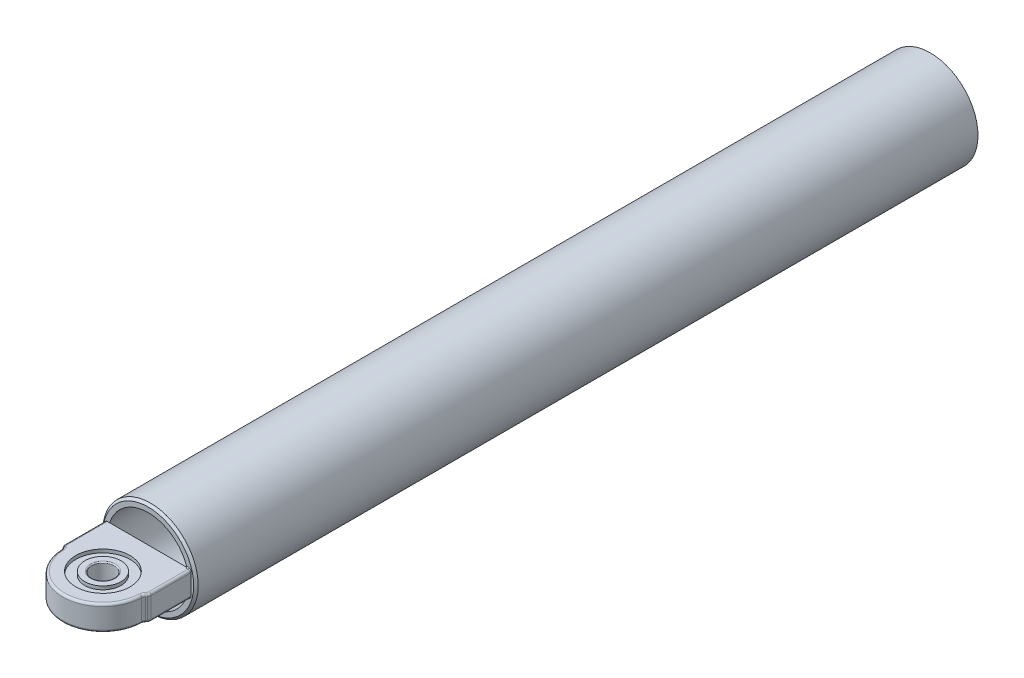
ISO-10303-21;
HEADER;
FILE_DESCRIPTION(('STEP AP214'),'2;1');
FILE_NAME('part.step','',(''),(''),'','','');
FILE_SCHEMA(('AUTOMOTIVE_DESIGN { 1 0 10303 214 1 1 1 1 }'));
ENDSEC;
DATA;
#1=APPLICATION_CONTEXT('core data for automotive mechanical design processes');
#2=APPLICATION_PROTOCOL_DEFINITION('international standard','automotive_design',2000,#1);
#3=PRODUCT_CONTEXT('',#1,'mechanical');
#4=PRODUCT('Part','Part','',(#3));
#5=PRODUCT_RELATED_PRODUCT_CATEGORY('part','',(#4));
#6=PRODUCT_DEFINITION_FORMATION('','',#4);
#7=PRODUCT_DEFINITION_CONTEXT('part definition',#1,'design');
#8=PRODUCT_DEFINITION('design','',#6,#7);
#9=PRODUCT_DEFINITION_SHAPE('','',#8);
#10=(LENGTH_UNIT() NAMED_UNIT(*) SI_UNIT(.MILLI.,.METRE.));
#11=(NAMED_UNIT(*) PLANE_ANGLE_UNIT() SI_UNIT($,.RADIAN.));
#12=(NAMED_UNIT(*) SI_UNIT($,.STERADIAN.) SOLID_ANGLE_UNIT());
#13=UNCERTAINTY_MEASURE_WITH_UNIT(LENGTH_MEASURE(1.E-05),#10,'distance_accuracy_value','');
#14=(GEOMETRIC_REPRESENTATION_CONTEXT(3) GLOBAL_UNCERTAINTY_ASSIGNED_CONTEXT((#13)) GLOBAL_UNIT_ASSIGNED_CONTEXT((#10,
#11,#12)) REPRESENTATION_CONTEXT('',''));
#15=CARTESIAN_POINT('',(0.,0.,0.));
#16=DIRECTION('',(0.,0.,1.));
#17=DIRECTION('',(1.,0.,0.));
#18=AXIS2_PLACEMENT_3D('',#15,#16,#17);
#19=CARTESIAN_POINT('',(-17.0226376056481,-5.5,190.455643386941));
#20=DIRECTION('',(0.,-1.,0.));
#21=DIRECTION('',(0.,0.,-1.));
#22=AXIS2_PLACEMENT_3D('',#19,#20,#21);
#23=PLANE('',#22);
#24=DIRECTION('',(-1.,0.,0.));
#25=VECTOR('',#24,1.);
#26=CARTESIAN_POINT('',(18.9773623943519,-5.5,173.22));
#27=LINE('',#26,#25);
#28=CARTESIAN_POINT('',(17.0574502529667,-5.5,173.22));
#29=VERTEX_POINT('',#28);
#30=CARTESIAN_POINT('',(17.9773623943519,-5.5,173.22));
#31=VERTEX_POINT('',#30);
#32=EDGE_CURVE('E713',#29,#31,#27,.F.);
#33=ORIENTED_EDGE('',*,*,#32,.T.);
#34=DIRECTION('',(0.,0.,-1.));
#35=VECTOR('',#34,1.);
#36=CARTESIAN_POINT('',(17.9773623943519,-5.5,190.455643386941));
#37=LINE('',#36,#35);
#38=CARTESIAN_POINT('',(17.9773623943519,-5.5,190.455643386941));
#39=VERTEX_POINT('',#38);
#40=EDGE_CURVE('E429',#31,#39,#37,.F.);
#41=ORIENTED_EDGE('',*,*,#40,.T.);
#42=CARTESIAN_POINT('',(16.9773623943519,-5.5,190.455643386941));
#43=DIRECTION('',(0.,-1.,0.));
#44=DIRECTION('',(0.,0.,-1.));
#45=AXIS2_PLACEMENT_3D('',#42,#43,#44);
#46=CIRCLE('',#45,1.00000000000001);
#47=CARTESIAN_POINT('',(17.7694539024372,-5.5,191.066045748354));
#48=VERTEX_POINT('',#47);
#49=EDGE_CURVE('E427',#39,#48,#46,.T.);
#50=ORIENTED_EDGE('',*,*,#49,.T.);
#51=DIRECTION('',(0.610402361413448,0.,-0.792091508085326));
#52=VECTOR('',#51,1.);
#53=CARTESIAN_POINT('',(17.3687978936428,-5.5,191.585958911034));
#54=LINE('',#53,#52);
#55=CARTESIAN_POINT('',(17.3687978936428,-5.5,191.585958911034));
#56=VERTEX_POINT('',#55);
#57=EDGE_CURVE('E425',#48,#56,#54,.F.);
#58=ORIENTED_EDGE('',*,*,#57,.T.);
#59=CARTESIAN_POINT('',(19.7450724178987,-5.5,193.417165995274));
#60=DIRECTION('',(0.,-1.,0.));
#61=DIRECTION('',(0.,0.,-1.));
#62=AXIS2_PLACEMENT_3D('',#59,#60,#61);
#63=CIRCLE('',#62,2.99999999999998);
#64=CARTESIAN_POINT('',(16.7469364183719,-5.5,193.311427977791));
#65=VERTEX_POINT('',#64);
#66=EDGE_CURVE('E423',#56,#65,#63,.F.);
#67=ORIENTED_EDGE('',*,*,#66,.T.);
#68=CARTESIAN_POINT('',(-0.0226376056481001,-5.5,192.72));
#69=DIRECTION('',(0.,-1.,0.));
#70=DIRECTION('',(0.,0.,-1.));
#71=AXIS2_PLACEMENT_3D('',#68,#69,#70);
#72=CIRCLE('',#71,16.78);
#73=CARTESIAN_POINT('',(-16.7922116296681,-5.5,193.311427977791));
#74=VERTEX_POINT('',#73);
#75=EDGE_CURVE('E421',#65,#74,#72,.T.);
#76=ORIENTED_EDGE('',*,*,#75,.T.);
#77=CARTESIAN_POINT('',(-19.7903476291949,-5.5,193.417165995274));
#78=DIRECTION('',(0.,-1.,0.));
#79=DIRECTION('',(0.,0.,-1.));
#80=AXIS2_PLACEMENT_3D('',#77,#78,#79);
#81=CIRCLE('',#80,2.99999999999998);
#82=CARTESIAN_POINT('',(-17.414073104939,-5.5,191.585958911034));
#83=VERTEX_POINT('',#82);
#84=EDGE_CURVE('E419',#74,#83,#81,.F.);
#85=ORIENTED_EDGE('',*,*,#84,.T.);
#86=DIRECTION('',(0.610402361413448,0.,0.792091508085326));
#87=VECTOR('',#86,1.);
#88=CARTESIAN_POINT('',(-17.8147291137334,-5.5,191.066045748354));
#89=LINE('',#88,#87);
#90=CARTESIAN_POINT('',(-17.8147291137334,-5.5,191.066045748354));
#91=VERTEX_POINT('',#90);
#92=EDGE_CURVE('E417',#83,#91,#89,.F.);
#93=ORIENTED_EDGE('',*,*,#92,.T.);
#94=CARTESIAN_POINT('',(-17.0226376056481,-5.5,190.455643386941));
#95=DIRECTION('',(0.,-1.,0.));
#96=DIRECTION('',(0.,0.,-1.));
#97=AXIS2_PLACEMENT_3D('',#94,#95,#96);
#98=CIRCLE('',#97,1.00000000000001);
#99=CARTESIAN_POINT('',(-18.0226376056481,-5.5,190.455643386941));
#100=VERTEX_POINT('',#99);
#101=EDGE_CURVE('E415',#91,#100,#98,.T.);
#102=ORIENTED_EDGE('',*,*,#101,.T.);
#103=DIRECTION('',(0.,0.,1.));
#104=VECTOR('',#103,1.);
#105=CARTESIAN_POINT('',(-18.0226376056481,-5.5,172.72));
#106=LINE('',#105,#104);
#107=CARTESIAN_POINT('',(-18.0226376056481,-5.5,172.72));
#108=VERTEX_POINT('',#107);
#109=EDGE_CURVE('E264',#100,#108,#106,.F.);
#110=ORIENTED_EDGE('',*,*,#109,.T.);
#111=DIRECTION('',(-1.,0.,0.));
#112=VECTOR('',#111,1.);
#113=CARTESIAN_POINT('',(-19.0226376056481,-5.5,172.72));
#114=LINE('',#113,#112);
#115=CARTESIAN_POINT('',(-17.0574502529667,-5.5,172.72));
#116=VERTEX_POINT('',#115);
#117=EDGE_CURVE('E260',#116,#108,#114,.T.);
#118=ORIENTED_EDGE('',*,*,#117,.F.);
#119=CARTESIAN_POINT('',(17.0574502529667,-5.5,172.72));
#120=VERTEX_POINT('',#119);
#121=EDGE_CURVE('E236',#120,#116,#114,.T.);
#122=ORIENTED_EDGE('',*,*,#121,.F.);
#123=DIRECTION('',(0.,0.,-1.));
#124=VECTOR('',#123,1.);
#125=CARTESIAN_POINT('',(17.0574502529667,-5.5,172.72));
#126=LINE('',#125,#124);
#127=EDGE_CURVE('E242',#120,#29,#126,.F.);
#128=ORIENTED_EDGE('',*,*,#127,.T.);
#129=EDGE_LOOP('',(#33,#41,#50,#58,#67,#76,#85,#93,#102,#110,#118,#122,#128));
#130=FACE_BOUND('',#129,.T.);
#131=CARTESIAN_POINT('',(-0.0226376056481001,-5.5,192.72));
#132=DIRECTION('',(0.,1.,0.));
#133=DIRECTION('',(0.,0.,1.));
#134=AXIS2_PLACEMENT_3D('',#131,#132,#133);
#135=CIRCLE('',#134,12.);
#136=CARTESIAN_POINT('',(-0.0226376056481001,-5.5,204.72));
#137=VERTEX_POINT('',#136);
#138=EDGE_CURVE('E599',#137,#137,#135,.T.);
#139=ORIENTED_EDGE('',*,*,#138,.T.);
#140=EDGE_LOOP('',(#139));
#141=FACE_BOUND('',#140,.T.);
#142=ADVANCED_FACE('F40',(#130,#141),#23,.T.);
#143=CARTESIAN_POINT('',(-17.0226376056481,5.5,190.455643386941));
#144=DIRECTION('',(0.,-1.,0.));
#145=DIRECTION('',(0.,0.,-1.));
#146=AXIS2_PLACEMENT_3D('',#143,#144,#145);
#147=PLANE('',#146);
#148=CARTESIAN_POINT('',(-0.0226376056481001,5.5,192.72));
#149=DIRECTION('',(0.,-1.,0.));
#150=DIRECTION('',(0.,0.,-1.));
#151=AXIS2_PLACEMENT_3D('',#148,#149,#150);
#152=CIRCLE('',#151,5.5);
#153=CARTESIAN_POINT('',(-0.0226376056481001,5.5,187.22));
#154=VERTEX_POINT('',#153);
#155=EDGE_CURVE('E11',#154,#154,#152,.T.);
#156=ORIENTED_EDGE('',*,*,#155,.T.);
#157=EDGE_LOOP('',(#156));
#158=FACE_BOUND('',#157,.T.);
#159=CARTESIAN_POINT('',(-0.0226376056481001,5.5,192.72));
#160=DIRECTION('',(0.,1.,0.));
#161=DIRECTION('',(0.,0.,1.));
#162=AXIS2_PLACEMENT_3D('',#159,#160,#161);
#163=CIRCLE('',#162,8.);
#164=CARTESIAN_POINT('',(-0.0226376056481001,5.5,200.72));
#165=VERTEX_POINT('',#164);
#166=EDGE_CURVE('E605',#165,#165,#163,.T.);
#167=ORIENTED_EDGE('',*,*,#166,.T.);
#168=EDGE_LOOP('',(#167));
#169=FACE_BOUND('',#168,.T.);
#170=ADVANCED_FACE('F366',(#158,#169),#147,.F.);
#171=CARTESIAN_POINT('',(0.,0.,172.72));
#172=DIRECTION('',(0.,0.,1.));
#173=DIRECTION('',(1.,0.,0.));
#174=AXIS2_PLACEMENT_3D('',#171,#172,#173);
#175=PLANE('',#174);
#176=CARTESIAN_POINT('',(0.,0.,172.72));
#177=DIRECTION('',(0.,0.,1.));
#178=DIRECTION('',(1.,0.,0.));
#179=AXIS2_PLACEMENT_3D('',#176,#177,#178);
#180=CIRCLE('',#179,20.065);
#181=CARTESIAN_POINT('',(20.065,0.,172.72));
#182=VERTEX_POINT('',#181);
#183=EDGE_CURVE('E265',#182,#182,#180,.T.);
#184=ORIENTED_EDGE('',*,*,#183,.T.);
#185=EDGE_LOOP('',(#184));
#186=FACE_BOUND('',#185,.T.);
#187=CARTESIAN_POINT('',(0.,0.,172.72));
#188=DIRECTION('',(0.,0.,1.));
#189=DIRECTION('',(1.,0.,0.));
#190=AXIS2_PLACEMENT_3D('',#187,#188,#189);
#191=CIRCLE('',#190,17.9222378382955);
#192=CARTESIAN_POINT('',(16.8880611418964,6.,172.72));
#193=VERTEX_POINT('',#192);
#194=CARTESIAN_POINT('',(-17.0574502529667,5.5,172.72));
#195=VERTEX_POINT('',#194);
#196=EDGE_CURVE('E247',#193,#195,#191,.T.);
#197=ORIENTED_EDGE('',*,*,#196,.F.);
#198=DIRECTION('',(-1.,0.,0.));
#199=VECTOR('',#198,1.);
#200=CARTESIAN_POINT('',(0.,6.,172.72));
#201=LINE('',#200,#199);
#202=CARTESIAN_POINT('',(17.9773623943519,6.,172.72));
#203=VERTEX_POINT('',#202);
#204=EDGE_CURVE('E647',#193,#203,#201,.F.);
#205=ORIENTED_EDGE('',*,*,#204,.T.);
#206=CARTESIAN_POINT('',(18.9773623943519,4.58578643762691,172.72));
#207=CARTESIAN_POINT('',(18.9773635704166,4.61770704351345,172.72));
#208=CARTESIAN_POINT('',(18.9760032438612,4.64960955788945,172.72));
#209=CARTESIAN_POINT('',(18.9706453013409,4.71317336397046,172.72));
#210=CARTESIAN_POINT('',(18.9666493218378,4.74483479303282,172.72));
#211=CARTESIAN_POINT('',(18.9508957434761,4.83883961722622,172.72));
#212=CARTESIAN_POINT('',(18.9353703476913,4.90058324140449,172.72));
#213=CARTESIAN_POINT('',(18.8943386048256,5.02376467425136,172.72));
#214=CARTESIAN_POINT('',(18.8684051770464,5.08505719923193,172.72));
#215=CARTESIAN_POINT('',(18.8080374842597,5.2033460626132,172.72));
#216=CARTESIAN_POINT('',(18.773593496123,5.26033738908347,172.72));
#217=CARTESIAN_POINT('',(18.7045608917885,5.3597688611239,172.72));
#218=CARTESIAN_POINT('',(18.671084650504,5.40299556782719,172.72));
#219=CARTESIAN_POINT('',(18.6003452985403,5.4862518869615,172.72));
#220=CARTESIAN_POINT('',(18.5630798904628,5.526279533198,172.72));
#221=CARTESIAN_POINT('',(18.446774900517,5.64201288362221,172.72));
#222=CARTESIAN_POINT('',(18.3633192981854,5.71324343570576,172.72));
#223=CARTESIAN_POINT('',(18.2291814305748,5.81819129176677,172.72));
#224=CARTESIAN_POINT('',(18.1804000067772,5.85452230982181,172.72));
#225=CARTESIAN_POINT('',(18.0819251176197,5.92602755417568,172.72));
#226=CARTESIAN_POINT('',(18.0322309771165,5.96120086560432,172.72));
#227=CARTESIAN_POINT('',(17.980805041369,5.99756568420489,172.72));
#228=CARTESIAN_POINT('',(17.9790837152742,5.9987828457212,172.72));
#229=CARTESIAN_POINT('',(17.9773623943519,6.,172.72));
#230=B_SPLINE_CURVE_WITH_KNOTS('',3,(#206,#207,#208,#209,#210,#211,#212,#213,#214,#215,#216,
#217,#218,#219,#220,#221,#222,#223,#224,#225,#226,#227,#228,#229),.UNSPECIFIED.,.F.,.F.,(4,2,2,
2,2,2,2,2,2,2,2,4),(0.,0.0957001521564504,0.191340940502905,0.381497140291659,0.580418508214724,
0.779568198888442,0.943344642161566,1.10722098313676,1.43543617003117,1.61792302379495,
1.80055078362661,1.80687533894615),.UNSPECIFIED.);
#231=CARTESIAN_POINT('',(18.9773623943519,4.58578643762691,172.72));
#232=VERTEX_POINT('',#231);
#233=EDGE_CURVE('E350',#203,#232,#230,.F.);
#234=ORIENTED_EDGE('',*,*,#233,.T.);
#235=DIRECTION('',(0.,-1.,0.));
#236=VECTOR('',#235,1.);
#237=CARTESIAN_POINT('',(18.9773623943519,5.5,172.72));
#238=LINE('',#237,#236);
#239=CARTESIAN_POINT('',(18.9773623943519,-4.58578643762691,172.72));
#240=VERTEX_POINT('',#239);
#241=EDGE_CURVE('E274',#232,#240,#238,.T.);
#242=ORIENTED_EDGE('',*,*,#241,.T.);
#243=CARTESIAN_POINT('',(18.9773623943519,-4.58578643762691,172.72));
#244=CARTESIAN_POINT('',(18.9773635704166,-4.61770704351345,172.72));
#245=CARTESIAN_POINT('',(18.9760032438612,-4.64960955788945,172.72));
#246=CARTESIAN_POINT('',(18.9706453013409,-4.71317336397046,172.72));
#247=CARTESIAN_POINT('',(18.9666493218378,-4.74483479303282,172.72));
#248=CARTESIAN_POINT('',(18.9508957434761,-4.83883961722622,172.72));
#249=CARTESIAN_POINT('',(18.9353703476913,-4.90058324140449,172.72));
#250=CARTESIAN_POINT('',(18.8943386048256,-5.02376467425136,172.72));
#251=CARTESIAN_POINT('',(18.8684051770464,-5.08505719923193,172.72));
#252=CARTESIAN_POINT('',(18.8080374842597,-5.2033460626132,172.72));
#253=CARTESIAN_POINT('',(18.773593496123,-5.26033738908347,172.72));
#254=CARTESIAN_POINT('',(18.7045608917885,-5.3597688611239,172.72));
#255=CARTESIAN_POINT('',(18.671084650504,-5.40299556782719,172.72));
#256=CARTESIAN_POINT('',(18.6003452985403,-5.4862518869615,172.72));
#257=CARTESIAN_POINT('',(18.5630798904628,-5.526279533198,172.72));
#258=CARTESIAN_POINT('',(18.446774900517,-5.64201288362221,172.72));
#259=CARTESIAN_POINT('',(18.3633192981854,-5.71324343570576,172.72));
#260=CARTESIAN_POINT('',(18.2291814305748,-5.81819129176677,172.72));
#261=CARTESIAN_POINT('',(18.1804000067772,-5.85452230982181,172.72));
#262=CARTESIAN_POINT('',(18.0819251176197,-5.92602755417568,172.72));
#263=CARTESIAN_POINT('',(18.0322309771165,-5.96120086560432,172.72));
#264=CARTESIAN_POINT('',(17.980805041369,-5.99756568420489,172.72));
#265=CARTESIAN_POINT('',(17.9790837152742,-5.9987828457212,172.72));
#266=CARTESIAN_POINT('',(17.9773623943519,-6.,172.72));
#267=B_SPLINE_CURVE_WITH_KNOTS('',3,(#243,#244,#245,#246,#247,#248,#249,#250,#251,#252,#253,
#254,#255,#256,#257,#258,#259,#260,#261,#262,#263,#264,#265,#266),.UNSPECIFIED.,.F.,.F.,(4,2,2,
2,2,2,2,2,2,2,2,4),(0.,0.0957001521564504,0.191340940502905,0.381497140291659,0.580418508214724,
0.779568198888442,0.943344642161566,1.10722098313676,1.43543617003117,1.61792302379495,
1.80055078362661,1.80687533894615),.UNSPECIFIED.);
#268=CARTESIAN_POINT('',(17.9773623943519,-6.,172.72));
#269=VERTEX_POINT('',#268);
#270=EDGE_CURVE('E343',#240,#269,#267,.T.);
#271=ORIENTED_EDGE('',*,*,#270,.T.);
#272=DIRECTION('',(-1.,0.,0.));
#273=VECTOR('',#272,1.);
#274=CARTESIAN_POINT('',(17.0574502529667,-6.,172.72));
#275=LINE('',#274,#273);
#276=CARTESIAN_POINT('',(16.8880611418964,-6.,172.72));
#277=VERTEX_POINT('',#276);
#278=EDGE_CURVE('E708',#269,#277,#275,.T.);
#279=ORIENTED_EDGE('',*,*,#278,.T.);
#280=EDGE_CURVE('E244',#116,#277,#191,.T.);
#281=ORIENTED_EDGE('',*,*,#280,.F.);
#282=ORIENTED_EDGE('',*,*,#117,.T.);
#283=CARTESIAN_POINT('',(-18.0226376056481,-4.5,172.72));
#284=DIRECTION('',(0.,0.,1.));
#285=DIRECTION('',(1.,0.,0.));
#286=AXIS2_PLACEMENT_3D('',#283,#284,#285);
#287=CIRCLE('',#286,1.);
#288=CARTESIAN_POINT('',(-19.0226376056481,-4.5,172.72));
#289=VERTEX_POINT('',#288);
#290=EDGE_CURVE('E55',#108,#289,#287,.F.);
#291=ORIENTED_EDGE('',*,*,#290,.T.);
#292=DIRECTION('',(0.,-1.,0.));
#293=VECTOR('',#292,1.);
#294=CARTESIAN_POINT('',(-19.0226376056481,5.5,172.72));
#295=LINE('',#294,#293);
#296=CARTESIAN_POINT('',(-19.0226376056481,4.5,172.72));
#297=VERTEX_POINT('',#296);
#298=EDGE_CURVE('E235',#297,#289,#295,.T.);
#299=ORIENTED_EDGE('',*,*,#298,.F.);
#300=CARTESIAN_POINT('',(-18.0226376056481,4.5,172.72));
#301=DIRECTION('',(0.,0.,1.));
#302=DIRECTION('',(1.,0.,0.));
#303=AXIS2_PLACEMENT_3D('',#300,#301,#302);
#304=CIRCLE('',#303,1.);
#305=CARTESIAN_POINT('',(-18.0226376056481,5.5,172.72));
#306=VERTEX_POINT('',#305);
#307=EDGE_CURVE('E530',#297,#306,#304,.F.);
#308=ORIENTED_EDGE('',*,*,#307,.T.);
#309=DIRECTION('',(-1.,0.,0.));
#310=VECTOR('',#309,1.);
#311=CARTESIAN_POINT('',(-19.0226376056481,5.5,172.72));
#312=LINE('',#311,#310);
#313=EDGE_CURVE('E238',#195,#306,#312,.T.);
#314=ORIENTED_EDGE('',*,*,#313,.F.);
#315=EDGE_LOOP('',(#197,#205,#234,#242,#271,#279,#281,#282,#291,#299,#308,#314));
#316=FACE_BOUND('',#315,.T.);
#317=ADVANCED_FACE('F360',(#186,#316),#175,.T.);
#318=CARTESIAN_POINT('',(0.,0.,-172.72));
#319=DIRECTION('',(0.,0.,1.));
#320=DIRECTION('',(1.,0.,0.));
#321=AXIS2_PLACEMENT_3D('',#318,#319,#320);
#322=PLANE('',#321);
#323=CARTESIAN_POINT('',(0.,0.,-172.72));
#324=DIRECTION('',(0.,0.,1.));
#325=DIRECTION('',(1.,0.,0.));
#326=AXIS2_PLACEMENT_3D('',#323,#324,#325);
#327=CIRCLE('',#326,21.065);
#328=CARTESIAN_POINT('',(21.065,0.,-172.72));
#329=VERTEX_POINT('',#328);
#330=EDGE_CURVE('E253',#329,#329,#327,.T.);
#331=ORIENTED_EDGE('',*,*,#330,.F.);
#332=EDGE_LOOP('',(#331));
#333=FACE_BOUND('',#332,.T.);
#334=CARTESIAN_POINT('',(0.,0.,-172.72));
#335=DIRECTION('',(0.,0.,1.));
#336=DIRECTION('',(1.,0.,0.));
#337=AXIS2_PLACEMENT_3D('',#334,#335,#336);
#338=CIRCLE('',#337,17.9222378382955);
#339=CARTESIAN_POINT('',(17.9222378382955,0.,-172.72));
#340=VERTEX_POINT('',#339);
#341=EDGE_CURVE('E245',#340,#340,#338,.T.);
#342=ORIENTED_EDGE('',*,*,#341,.T.);
#343=EDGE_LOOP('',(#342));
#344=FACE_BOUND('',#343,.T.);
#345=ADVANCED_FACE('F365',(#333,#344),#322,.F.);
#346=CARTESIAN_POINT('',(0.,0.,172.72));
#347=DIRECTION('',(0.,0.,-1.));
#348=DIRECTION('',(-1.,0.,0.));
#349=AXIS2_PLACEMENT_3D('',#346,#347,#348);
#350=CYLINDRICAL_SURFACE('',#349,21.065);
#351=CARTESIAN_POINT('',(0.,0.,171.72));
#352=DIRECTION('',(0.,0.,1.));
#353=DIRECTION('',(1.,0.,0.));
#354=AXIS2_PLACEMENT_3D('',#351,#352,#353);
#355=CIRCLE('',#354,21.065);
#356=CARTESIAN_POINT('',(21.065,0.,171.72));
#357=VERTEX_POINT('',#356);
#358=EDGE_CURVE('E225',#357,#357,#355,.F.);
#359=ORIENTED_EDGE('',*,*,#358,.T.);
#360=EDGE_LOOP('',(#359));
#361=FACE_BOUND('',#360,.T.);
#362=ORIENTED_EDGE('',*,*,#330,.T.);
#363=EDGE_LOOP('',(#362));
#364=FACE_BOUND('',#363,.T.);
#365=ADVANCED_FACE('F373',(#361,#364),#350,.T.);
#366=CARTESIAN_POINT('',(0.,0.,172.72));
#367=DIRECTION('',(0.,0.,-1.));
#368=DIRECTION('',(-1.,0.,0.));
#369=AXIS2_PLACEMENT_3D('',#366,#367,#368);
#370=CYLINDRICAL_SURFACE('',#369,17.9222378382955);
#371=CARTESIAN_POINT('',(17.0574502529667,5.5,172.72));
#372=VERTEX_POINT('',#371);
#373=EDGE_CURVE('E232',#120,#372,#191,.T.);
#374=ORIENTED_EDGE('',*,*,#373,.T.);
#375=DIRECTION('',(0.,0.,-1.));
#376=VECTOR('',#375,1.);
#377=CARTESIAN_POINT('',(17.0574502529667,5.5,173.22));
#378=LINE('',#377,#376);
#379=CARTESIAN_POINT('',(17.0574502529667,5.5,173.22));
#380=VERTEX_POINT('',#379);
#381=EDGE_CURVE('E215',#380,#372,#378,.T.);
#382=ORIENTED_EDGE('',*,*,#381,.F.);
#383=CARTESIAN_POINT('',(17.0574502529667,5.5,173.22));
#384=CARTESIAN_POINT('',(17.0574574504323,5.49997194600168,173.192876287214));
#385=CARTESIAN_POINT('',(17.0567391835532,5.50220522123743,173.165766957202));
#386=CARTESIAN_POINT('',(17.053907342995,5.51097915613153,173.112384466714));
#387=CARTESIAN_POINT('',(17.0517966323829,5.51751097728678,173.086109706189));
#388=CARTESIAN_POINT('',(17.0462349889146,5.5346687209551,173.035085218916));
#389=CARTESIAN_POINT('',(17.0427839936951,5.54529483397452,173.010335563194));
#390=CARTESIAN_POINT('',(17.0346394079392,5.57026411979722,172.963012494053));
#391=CARTESIAN_POINT('',(17.0299455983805,5.58460794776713,172.94043946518));
#392=CARTESIAN_POINT('',(17.0193378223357,5.61685334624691,172.897616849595));
#393=CARTESIAN_POINT('',(17.0134021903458,5.63481784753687,172.877420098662));
#394=CARTESIAN_POINT('',(17.0005212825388,5.67356163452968,172.840318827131));
#395=CARTESIAN_POINT('',(16.9935757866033,5.69434153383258,172.823415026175));
#396=CARTESIAN_POINT('',(16.9785049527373,5.73912547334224,172.792545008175));
#397=CARTESIAN_POINT('',(16.9703400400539,5.76323385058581,172.778749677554));
#398=CARTESIAN_POINT('',(16.9532930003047,5.8131886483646,172.755390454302));
#399=CARTESIAN_POINT('',(16.9444107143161,5.83903545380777,172.745827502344));
#400=CARTESIAN_POINT('',(16.9276662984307,5.8873816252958,172.732313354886));
#401=CARTESIAN_POINT('',(16.9198798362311,5.90972374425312,172.727693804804));
#402=CARTESIAN_POINT('',(16.9040985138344,5.95471577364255,172.721537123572));
#403=CARTESIAN_POINT('',(16.8961040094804,5.9773651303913,172.719995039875));
#404=CARTESIAN_POINT('',(16.8880611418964,6.,172.72));
#405=B_SPLINE_CURVE_WITH_KNOTS('',3,(#383,#384,#385,#386,#387,#388,#389,#390,#391,#392,#393,
#394,#395,#396,#397,#398,#399,#400,#401,#402,#403,#404),.UNSPECIFIED.,.F.,.F.,(4,2,2,2,2,2,2,2,
2,2,4),(0.,0.0812478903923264,0.16232924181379,0.243414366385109,0.324513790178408,
0.407167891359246,0.489840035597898,0.576314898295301,0.662808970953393,0.734933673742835,
0.806942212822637),.UNSPECIFIED.);
#406=EDGE_CURVE('E390',#380,#193,#405,.T.);
#407=ORIENTED_EDGE('',*,*,#406,.T.);
#408=ORIENTED_EDGE('',*,*,#196,.T.);
#409=EDGE_CURVE('E234',#195,#116,#191,.T.);
#410=ORIENTED_EDGE('',*,*,#409,.T.);
#411=ORIENTED_EDGE('',*,*,#280,.T.);
#412=CARTESIAN_POINT('',(16.8880611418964,-6.,172.72));
#413=CARTESIAN_POINT('',(16.8984483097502,-5.97077286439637,172.719981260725));
#414=CARTESIAN_POINT('',(16.9087563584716,-5.94150937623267,172.722562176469));
#415=CARTESIAN_POINT('',(16.9289556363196,-5.88370450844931,172.732831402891));
#416=CARTESIAN_POINT('',(16.9388463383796,-5.85516405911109,172.740525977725));
#417=CARTESIAN_POINT('',(16.9579378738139,-5.79963995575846,172.760943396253));
#418=CARTESIAN_POINT('',(16.9671377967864,-5.77265836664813,172.773672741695));
#419=CARTESIAN_POINT('',(16.9845655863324,-5.72117797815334,172.803889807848));
#420=CARTESIAN_POINT('',(16.9927942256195,-5.69667720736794,172.821373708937));
#421=CARTESIAN_POINT('',(17.0077815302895,-5.65177137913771,172.860021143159));
#422=CARTESIAN_POINT('',(17.014580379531,-5.63125614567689,172.881040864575));
#423=CARTESIAN_POINT('',(17.0268425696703,-5.59407058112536,172.926597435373));
#424=CARTESIAN_POINT('',(17.0323058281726,-5.57740048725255,172.951134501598));
#425=CARTESIAN_POINT('',(17.0414711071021,-5.54933139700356,173.001623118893));
#426=CARTESIAN_POINT('',(17.0452506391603,-5.53770130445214,173.027432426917));
#427=CARTESIAN_POINT('',(17.0513336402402,-5.51894271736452,173.080785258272));
#428=CARTESIAN_POINT('',(17.0536390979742,-5.51180815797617,173.108326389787));
#429=CARTESIAN_POINT('',(17.0559310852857,-5.50470973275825,173.150106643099));
#430=CARTESIAN_POINT('',(17.0565007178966,-5.5029441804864,173.164031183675));
#431=CARTESIAN_POINT('',(17.0572599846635,-5.50059012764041,173.191968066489));
#432=CARTESIAN_POINT('',(17.0574502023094,-5.49999981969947,173.205980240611));
#433=CARTESIAN_POINT('',(17.0574502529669,-5.49999999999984,173.22));
#434=B_SPLINE_CURVE_WITH_KNOTS('',3,(#412,#413,#414,#415,#416,#417,#418,#419,#420,#421,#422,
#423,#424,#425,#426,#427,#428,#429,#430,#431,#432,#433),.UNSPECIFIED.,.F.,.F.,(4,2,2,2,2,2,2,2,
2,2,4),(0.,0.0929601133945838,0.186034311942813,0.279229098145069,0.372349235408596,
0.462332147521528,0.552320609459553,0.637576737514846,0.722717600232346,0.76481299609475,
0.806843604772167),.UNSPECIFIED.);
#435=EDGE_CURVE('E396',#277,#29,#434,.T.);
#436=ORIENTED_EDGE('',*,*,#435,.T.);
#437=ORIENTED_EDGE('',*,*,#127,.F.);
#438=EDGE_LOOP('',(#374,#382,#407,#408,#410,#411,#436,#437));
#439=FACE_BOUND('',#438,.T.);
#440=ORIENTED_EDGE('',*,*,#341,.F.);
#441=EDGE_LOOP('',(#440));
#442=FACE_BOUND('',#441,.T.);
#443=ADVANCED_FACE('F239',(#439,#442),#370,.F.);
#444=CARTESIAN_POINT('',(-0.0226376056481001,5.5,192.72));
#445=DIRECTION('',(0.,1.,0.));
#446=DIRECTION('',(0.,0.,1.));
#447=AXIS2_PLACEMENT_3D('',#444,#445,#446);
#448=CIRCLE('',#447,12.);
#449=CARTESIAN_POINT('',(-0.0226376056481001,5.5,204.72));
#450=VERTEX_POINT('',#449);
#451=EDGE_CURVE('E611',#450,#450,#448,.T.);
#452=ORIENTED_EDGE('',*,*,#451,.F.);
#453=EDGE_LOOP('',(#452));
#454=FACE_BOUND('',#453,.T.);
#455=CARTESIAN_POINT('',(16.9773623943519,5.5,190.455643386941));
#456=DIRECTION('',(0.,-1.,0.));
#457=DIRECTION('',(0.,0.,-1.));
#458=AXIS2_PLACEMENT_3D('',#455,#456,#457);
#459=CIRCLE('',#458,1.00000000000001);
#460=CARTESIAN_POINT('',(17.7694539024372,5.5,191.066045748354));
#461=VERTEX_POINT('',#460);
#462=CARTESIAN_POINT('',(17.9773623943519,5.5,190.455643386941));
#463=VERTEX_POINT('',#462);
#464=EDGE_CURVE('E337',#461,#463,#459,.F.);
#465=ORIENTED_EDGE('',*,*,#464,.T.);
#466=DIRECTION('',(0.,0.,-1.));
#467=VECTOR('',#466,1.);
#468=CARTESIAN_POINT('',(17.9773623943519,5.5,190.455643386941));
#469=LINE('',#468,#467);
#470=CARTESIAN_POINT('',(17.9773623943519,5.5,173.22));
#471=VERTEX_POINT('',#470);
#472=EDGE_CURVE('E339',#463,#471,#469,.T.);
#473=ORIENTED_EDGE('',*,*,#472,.T.);
#474=DIRECTION('',(-1.,0.,0.));
#475=VECTOR('',#474,1.);
#476=CARTESIAN_POINT('',(-17.0226376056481,5.5,173.22));
#477=LINE('',#476,#475);
#478=EDGE_CURVE('E221',#471,#380,#477,.T.);
#479=ORIENTED_EDGE('',*,*,#478,.T.);
#480=ORIENTED_EDGE('',*,*,#381,.T.);
#481=EDGE_CURVE('E219',#372,#195,#312,.T.);
#482=ORIENTED_EDGE('',*,*,#481,.T.);
#483=ORIENTED_EDGE('',*,*,#313,.T.);
#484=DIRECTION('',(0.,0.,1.));
#485=VECTOR('',#484,1.);
#486=CARTESIAN_POINT('',(-18.0226376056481,5.5,190.455643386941));
#487=LINE('',#486,#485);
#488=CARTESIAN_POINT('',(-18.0226376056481,5.5,190.455643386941));
#489=VERTEX_POINT('',#488);
#490=EDGE_CURVE('E318',#306,#489,#487,.T.);
#491=ORIENTED_EDGE('',*,*,#490,.T.);
#492=CARTESIAN_POINT('',(-17.0226376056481,5.5,190.455643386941));
#493=DIRECTION('',(0.,-1.,0.));
#494=DIRECTION('',(0.,0.,-1.));
#495=AXIS2_PLACEMENT_3D('',#492,#493,#494);
#496=CIRCLE('',#495,1.00000000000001);
#497=CARTESIAN_POINT('',(-17.8147291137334,5.5,191.066045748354));
#498=VERTEX_POINT('',#497);
#499=EDGE_CURVE('E325',#489,#498,#496,.F.);
#500=ORIENTED_EDGE('',*,*,#499,.T.);
#501=DIRECTION('',(0.610402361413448,0.,0.792091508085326));
#502=VECTOR('',#501,1.);
#503=CARTESIAN_POINT('',(-17.8147291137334,5.5,191.066045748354));
#504=LINE('',#503,#502);
#505=CARTESIAN_POINT('',(-17.414073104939,5.5,191.585958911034));
#506=VERTEX_POINT('',#505);
#507=EDGE_CURVE('E327',#498,#506,#504,.T.);
#508=ORIENTED_EDGE('',*,*,#507,.T.);
#509=CARTESIAN_POINT('',(-19.7903476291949,5.5,193.417165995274));
#510=DIRECTION('',(0.,-1.,0.));
#511=DIRECTION('',(0.,0.,-1.));
#512=AXIS2_PLACEMENT_3D('',#509,#510,#511);
#513=CIRCLE('',#512,2.99999999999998);
#514=CARTESIAN_POINT('',(-16.7922116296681,5.5,193.311427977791));
#515=VERTEX_POINT('',#514);
#516=EDGE_CURVE('E329',#506,#515,#513,.T.);
#517=ORIENTED_EDGE('',*,*,#516,.T.);
#518=CARTESIAN_POINT('',(-0.0226376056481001,5.5,192.72));
#519=DIRECTION('',(0.,-1.,0.));
#520=DIRECTION('',(0.,0.,-1.));
#521=AXIS2_PLACEMENT_3D('',#518,#519,#520);
#522=CIRCLE('',#521,16.78);
#523=CARTESIAN_POINT('',(16.7469364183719,5.5,193.311427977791));
#524=VERTEX_POINT('',#523);
#525=EDGE_CURVE('E331',#515,#524,#522,.F.);
#526=ORIENTED_EDGE('',*,*,#525,.T.);
#527=CARTESIAN_POINT('',(19.7450724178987,5.5,193.417165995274));
#528=DIRECTION('',(0.,-1.,0.));
#529=DIRECTION('',(0.,0.,-1.));
#530=AXIS2_PLACEMENT_3D('',#527,#528,#529);
#531=CIRCLE('',#530,2.99999999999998);
#532=CARTESIAN_POINT('',(17.3687978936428,5.5,191.585958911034));
#533=VERTEX_POINT('',#532);
#534=EDGE_CURVE('E333',#524,#533,#531,.T.);
#535=ORIENTED_EDGE('',*,*,#534,.T.);
#536=DIRECTION('',(0.610402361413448,0.,-0.792091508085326));
#537=VECTOR('',#536,1.);
#538=CARTESIAN_POINT('',(5.10135844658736,5.5,207.504859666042));
#539=LINE('',#538,#537);
#540=EDGE_CURVE('E335',#533,#461,#539,.T.);
#541=ORIENTED_EDGE('',*,*,#540,.T.);
#542=EDGE_LOOP('',(#465,#473,#479,#480,#482,#483,#491,#500,#508,#517,#526,#535,#541));
#543=FACE_BOUND('',#542,.T.);
#544=ADVANCED_FACE('F217',(#454,#543),#147,.F.);
#545=CARTESIAN_POINT('',(-0.0226376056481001,-5.5,192.72));
#546=DIRECTION('',(0.,1.,0.));
#547=DIRECTION('',(0.,0.,1.));
#548=AXIS2_PLACEMENT_3D('',#545,#546,#547);
#549=CIRCLE('',#548,8.);
#550=CARTESIAN_POINT('',(-0.0226376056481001,-5.5,200.72));
#551=VERTEX_POINT('',#550);
#552=EDGE_CURVE('E597',#551,#551,#549,.T.);
#553=ORIENTED_EDGE('',*,*,#552,.F.);
#554=EDGE_LOOP('',(#553));
#555=FACE_BOUND('',#554,.T.);
#556=CARTESIAN_POINT('',(-0.0226376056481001,-5.5,192.72));
#557=DIRECTION('',(0.,-1.,0.));
#558=DIRECTION('',(0.,0.,-1.));
#559=AXIS2_PLACEMENT_3D('',#556,#557,#558);
#560=CIRCLE('',#559,5.5);
#561=CARTESIAN_POINT('',(-0.0226376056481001,-5.5,187.22));
#562=VERTEX_POINT('',#561);
#563=EDGE_CURVE('E526',#562,#562,#560,.F.);
#564=ORIENTED_EDGE('',*,*,#563,.T.);
#565=EDGE_LOOP('',(#564));
#566=FACE_BOUND('',#565,.T.);
#567=ADVANCED_FACE('F543',(#555,#566),#23,.T.);
#568=CARTESIAN_POINT('',(-19.0226376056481,5.5,172.72));
#569=DIRECTION('',(1.,0.,0.));
#570=DIRECTION('',(0.,0.,-1.));
#571=AXIS2_PLACEMENT_3D('',#568,#569,#570);
#572=PLANE('',#571);
#573=ORIENTED_EDGE('',*,*,#298,.T.);
#574=DIRECTION('',(0.,0.,1.));
#575=VECTOR('',#574,1.);
#576=CARTESIAN_POINT('',(-19.0226376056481,-4.5,190.455643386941));
#577=LINE('',#576,#575);
#578=CARTESIAN_POINT('',(-19.0226376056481,-4.5,190.455643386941));
#579=VERTEX_POINT('',#578);
#580=EDGE_CURVE('E309',#289,#579,#577,.T.);
#581=ORIENTED_EDGE('',*,*,#580,.T.);
#582=DIRECTION('',(0.,-1.,0.));
#583=VECTOR('',#582,1.);
#584=CARTESIAN_POINT('',(-19.0226376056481,5.5,190.455643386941));
#585=LINE('',#584,#583);
#586=CARTESIAN_POINT('',(-19.0226376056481,4.5,190.455643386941));
#587=VERTEX_POINT('',#586);
#588=EDGE_CURVE('E250',#587,#579,#585,.T.);
#589=ORIENTED_EDGE('',*,*,#588,.F.);
#590=DIRECTION('',(0.,0.,1.));
#591=VECTOR('',#590,1.);
#592=CARTESIAN_POINT('',(-19.0226376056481,4.5,172.72));
#593=LINE('',#592,#591);
#594=EDGE_CURVE('E62',#587,#297,#593,.F.);
#595=ORIENTED_EDGE('',*,*,#594,.T.);
#596=EDGE_LOOP('',(#573,#581,#589,#595));
#597=FACE_BOUND('',#596,.T.);
#598=ADVANCED_FACE('F545',(#597),#572,.F.);
#599=CARTESIAN_POINT('',(-17.0226376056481,5.5,190.455643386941));
#600=DIRECTION('',(0.,-1.,0.));
#601=DIRECTION('',(0.,0.,-1.));
#602=AXIS2_PLACEMENT_3D('',#599,#600,#601);
#603=CYLINDRICAL_SURFACE('',#602,2.00000000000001);
#604=ORIENTED_EDGE('',*,*,#588,.T.);
#605=CARTESIAN_POINT('',(-17.0226376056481,-4.5,190.455643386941));
#606=DIRECTION('',(0.,-1.,0.));
#607=DIRECTION('',(0.,0.,-1.));
#608=AXIS2_PLACEMENT_3D('',#605,#606,#607);
#609=CIRCLE('',#608,2.00000000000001);
#610=CARTESIAN_POINT('',(-18.6068206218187,-4.5,191.676448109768));
#611=VERTEX_POINT('',#610);
#612=EDGE_CURVE('E303',#579,#611,#609,.F.);
#613=ORIENTED_EDGE('',*,*,#612,.T.);
#614=DIRECTION('',(0.,-1.,0.));
#615=VECTOR('',#614,1.);
#616=CARTESIAN_POINT('',(-18.6068206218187,5.5,191.676448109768));
#617=LINE('',#616,#615);
#618=CARTESIAN_POINT('',(-18.6068206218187,4.5,191.676448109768));
#619=VERTEX_POINT('',#618);
#620=EDGE_CURVE('E295',#619,#611,#617,.T.);
#621=ORIENTED_EDGE('',*,*,#620,.F.);
#622=CARTESIAN_POINT('',(-17.0226376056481,4.5,190.455643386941));
#623=DIRECTION('',(0.,-1.,0.));
#624=DIRECTION('',(0.,0.,-1.));
#625=AXIS2_PLACEMENT_3D('',#622,#623,#624);
#626=CIRCLE('',#625,2.00000000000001);
#627=EDGE_CURVE('E305',#619,#587,#626,.T.);
#628=ORIENTED_EDGE('',*,*,#627,.T.);
#629=EDGE_LOOP('',(#604,#613,#621,#628));
#630=FACE_BOUND('',#629,.T.);
#631=ADVANCED_FACE('F300',(#630),#603,.T.);
#632=CARTESIAN_POINT('',(-18.2061646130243,5.5,192.196361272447));
#633=DIRECTION('',(0.792091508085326,0.,-0.610402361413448));
#634=DIRECTION('',(-0.610402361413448,0.,-0.792091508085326));
#635=AXIS2_PLACEMENT_3D('',#632,#633,#634);
#636=PLANE('',#635);
#637=ORIENTED_EDGE('',*,*,#620,.T.);
#638=DIRECTION('',(0.610402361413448,0.,0.792091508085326));
#639=VECTOR('',#638,1.);
#640=CARTESIAN_POINT('',(-18.2061646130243,-4.5,192.196361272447));
#641=LINE('',#640,#639);
#642=CARTESIAN_POINT('',(-18.2061646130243,-4.5,192.196361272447));
#643=VERTEX_POINT('',#642);
#644=EDGE_CURVE('E320',#611,#643,#641,.T.);
#645=ORIENTED_EDGE('',*,*,#644,.T.);
#646=DIRECTION('',(0.,-1.,0.));
#647=VECTOR('',#646,1.);
#648=CARTESIAN_POINT('',(-18.2061646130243,5.5,192.196361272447));
#649=LINE('',#648,#647);
#650=CARTESIAN_POINT('',(-18.2061646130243,4.5,192.196361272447));
#651=VERTEX_POINT('',#650);
#652=EDGE_CURVE('E292',#651,#643,#649,.T.);
#653=ORIENTED_EDGE('',*,*,#652,.F.);
#654=DIRECTION('',(0.610402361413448,0.,0.792091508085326));
#655=VECTOR('',#654,1.);
#656=CARTESIAN_POINT('',(-18.2061646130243,4.5,192.196361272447));
#657=LINE('',#656,#655);
#658=EDGE_CURVE('E451',#651,#619,#657,.F.);
#659=ORIENTED_EDGE('',*,*,#658,.T.);
#660=EDGE_LOOP('',(#637,#645,#653,#659));
#661=FACE_BOUND('',#660,.T.);
#662=ADVANCED_FACE('F454',(#661),#636,.F.);
#663=CARTESIAN_POINT('',(-19.7903476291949,5.5,193.417165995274));
#664=DIRECTION('',(0.,-1.,0.));
#665=DIRECTION('',(0.,0.,-1.));
#666=AXIS2_PLACEMENT_3D('',#663,#664,#665);
#667=CYLINDRICAL_SURFACE('',#666,1.99999999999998);
#668=ORIENTED_EDGE('',*,*,#652,.T.);
#669=CARTESIAN_POINT('',(-19.7903476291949,-4.5,193.417165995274));
#670=DIRECTION('',(0.,-1.,0.));
#671=DIRECTION('',(0.,0.,-1.));
#672=AXIS2_PLACEMENT_3D('',#669,#670,#671);
#673=CIRCLE('',#672,1.99999999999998);
#674=CARTESIAN_POINT('',(-17.791590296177,-4.5,193.346673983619));
#675=VERTEX_POINT('',#674);
#676=EDGE_CURVE('E449',#643,#675,#673,.T.);
#677=ORIENTED_EDGE('',*,*,#676,.T.);
#678=DIRECTION('',(0.,-1.,0.));
#679=VECTOR('',#678,1.);
#680=CARTESIAN_POINT('',(-17.791590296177,5.5,193.346673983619));
#681=LINE('',#680,#679);
#682=CARTESIAN_POINT('',(-17.791590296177,4.5,193.346673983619));
#683=VERTEX_POINT('',#682);
#684=EDGE_CURVE('E289',#683,#675,#681,.T.);
#685=ORIENTED_EDGE('',*,*,#684,.F.);
#686=CARTESIAN_POINT('',(-19.7903476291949,4.5,193.417165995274));
#687=DIRECTION('',(0.,-1.,0.));
#688=DIRECTION('',(0.,0.,-1.));
#689=AXIS2_PLACEMENT_3D('',#686,#687,#688);
#690=CIRCLE('',#689,1.99999999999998);
#691=EDGE_CURVE('E447',#683,#651,#690,.F.);
#692=ORIENTED_EDGE('',*,*,#691,.T.);
#693=EDGE_LOOP('',(#668,#677,#685,#692));
#694=FACE_BOUND('',#693,.T.);
#695=ADVANCED_FACE('F459',(#694),#667,.F.);
#696=CARTESIAN_POINT('',(-0.0226376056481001,5.5,192.72));
#697=DIRECTION('',(0.,-1.,0.));
#698=DIRECTION('',(0.,0.,-1.));
#699=AXIS2_PLACEMENT_3D('',#696,#697,#698);
#700=CYLINDRICAL_SURFACE('',#699,17.78);
#701=ORIENTED_EDGE('',*,*,#684,.T.);
#702=CARTESIAN_POINT('',(-0.0226376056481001,-4.5,192.72));
#703=DIRECTION('',(0.,-1.,0.));
#704=DIRECTION('',(0.,0.,-1.));
#705=AXIS2_PLACEMENT_3D('',#702,#703,#704);
#706=CIRCLE('',#705,17.78);
#707=CARTESIAN_POINT('',(17.7463150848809,-4.5,193.346673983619));
#708=VERTEX_POINT('',#707);
#709=EDGE_CURVE('E445',#675,#708,#706,.F.);
#710=ORIENTED_EDGE('',*,*,#709,.T.);
#711=DIRECTION('',(0.,-1.,0.));
#712=VECTOR('',#711,1.);
#713=CARTESIAN_POINT('',(17.7463150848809,5.5,193.346673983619));
#714=LINE('',#713,#712);
#715=CARTESIAN_POINT('',(17.7463150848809,4.5,193.346673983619));
#716=VERTEX_POINT('',#715);
#717=EDGE_CURVE('E286',#716,#708,#714,.T.);
#718=ORIENTED_EDGE('',*,*,#717,.F.);
#719=CARTESIAN_POINT('',(-0.0226376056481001,4.5,192.72));
#720=DIRECTION('',(0.,-1.,0.));
#721=DIRECTION('',(0.,0.,-1.));
#722=AXIS2_PLACEMENT_3D('',#719,#720,#721);
#723=CIRCLE('',#722,17.78);
#724=EDGE_CURVE('E443',#716,#683,#723,.T.);
#725=ORIENTED_EDGE('',*,*,#724,.T.);
#726=EDGE_LOOP('',(#701,#710,#718,#725));
#727=FACE_BOUND('',#726,.T.);
#728=ADVANCED_FACE('F485',(#727),#700,.T.);
#729=CARTESIAN_POINT('',(19.7450724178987,5.5,193.417165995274));
#730=DIRECTION('',(0.,-1.,0.));
#731=DIRECTION('',(0.,0.,-1.));
#732=AXIS2_PLACEMENT_3D('',#729,#730,#731);
#733=CYLINDRICAL_SURFACE('',#732,1.99999999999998);
#734=ORIENTED_EDGE('',*,*,#717,.T.);
#735=CARTESIAN_POINT('',(19.7450724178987,-4.5,193.417165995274));
#736=DIRECTION('',(0.,-1.,0.));
#737=DIRECTION('',(0.,0.,-1.));
#738=AXIS2_PLACEMENT_3D('',#735,#736,#737);
#739=CIRCLE('',#738,1.99999999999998);
#740=CARTESIAN_POINT('',(18.1608894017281,-4.5,192.196361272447));
#741=VERTEX_POINT('',#740);
#742=EDGE_CURVE('E441',#708,#741,#739,.T.);
#743=ORIENTED_EDGE('',*,*,#742,.T.);
#744=DIRECTION('',(0.,-1.,0.));
#745=VECTOR('',#744,1.);
#746=CARTESIAN_POINT('',(18.1608894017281,5.5,192.196361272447));
#747=LINE('',#746,#745);
#748=CARTESIAN_POINT('',(18.1608894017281,4.5,192.196361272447));
#749=VERTEX_POINT('',#748);
#750=EDGE_CURVE('E283',#749,#741,#747,.T.);
#751=ORIENTED_EDGE('',*,*,#750,.F.);
#752=CARTESIAN_POINT('',(19.7450724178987,4.5,193.417165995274));
#753=DIRECTION('',(0.,-1.,0.));
#754=DIRECTION('',(0.,0.,-1.));
#755=AXIS2_PLACEMENT_3D('',#752,#753,#754);
#756=CIRCLE('',#755,1.99999999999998);
#757=EDGE_CURVE('E439',#749,#716,#756,.F.);
#758=ORIENTED_EDGE('',*,*,#757,.T.);
#759=EDGE_LOOP('',(#734,#743,#751,#758));
#760=FACE_BOUND('',#759,.T.);
#761=ADVANCED_FACE('F488',(#760),#733,.F.);
#762=CARTESIAN_POINT('',(18.5615454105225,5.5,191.676448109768));
#763=DIRECTION('',(-0.792091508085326,0.,-0.610402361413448));
#764=DIRECTION('',(-0.610402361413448,0.,0.792091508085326));
#765=AXIS2_PLACEMENT_3D('',#762,#763,#764);
#766=PLANE('',#765);
#767=ORIENTED_EDGE('',*,*,#750,.T.);
#768=DIRECTION('',(0.610402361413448,0.,-0.792091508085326));
#769=VECTOR('',#768,1.);
#770=CARTESIAN_POINT('',(18.5615454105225,-4.5,191.676448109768));
#771=LINE('',#770,#769);
#772=CARTESIAN_POINT('',(18.5615454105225,-4.5,191.676448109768));
#773=VERTEX_POINT('',#772);
#774=EDGE_CURVE('E437',#741,#773,#771,.T.);
#775=ORIENTED_EDGE('',*,*,#774,.T.);
#776=DIRECTION('',(0.,-1.,0.));
#777=VECTOR('',#776,1.);
#778=CARTESIAN_POINT('',(18.5615454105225,5.5,191.676448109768));
#779=LINE('',#778,#777);
#780=CARTESIAN_POINT('',(18.5615454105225,4.5,191.676448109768));
#781=VERTEX_POINT('',#780);
#782=EDGE_CURVE('E280',#781,#773,#779,.T.);
#783=ORIENTED_EDGE('',*,*,#782,.F.);
#784=DIRECTION('',(0.610402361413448,0.,-0.792091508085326));
#785=VECTOR('',#784,1.);
#786=CARTESIAN_POINT('',(18.5615454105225,4.5,191.676448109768));
#787=LINE('',#786,#785);
#788=EDGE_CURVE('E435',#781,#749,#787,.F.);
#789=ORIENTED_EDGE('',*,*,#788,.T.);
#790=EDGE_LOOP('',(#767,#775,#783,#789));
#791=FACE_BOUND('',#790,.T.);
#792=ADVANCED_FACE('F794',(#791),#766,.F.);
#793=CARTESIAN_POINT('',(16.9773623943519,5.5,190.455643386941));
#794=DIRECTION('',(0.,-1.,0.));
#795=DIRECTION('',(0.,0.,-1.));
#796=AXIS2_PLACEMENT_3D('',#793,#794,#795);
#797=CYLINDRICAL_SURFACE('',#796,2.00000000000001);
#798=ORIENTED_EDGE('',*,*,#782,.T.);
#799=CARTESIAN_POINT('',(16.9773623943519,-4.5,190.455643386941));
#800=DIRECTION('',(0.,-1.,0.));
#801=DIRECTION('',(0.,0.,-1.));
#802=AXIS2_PLACEMENT_3D('',#799,#800,#801);
#803=CIRCLE('',#802,2.00000000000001);
#804=CARTESIAN_POINT('',(18.9773623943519,-4.5,190.455643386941));
#805=VERTEX_POINT('',#804);
#806=EDGE_CURVE('E433',#773,#805,#803,.F.);
#807=ORIENTED_EDGE('',*,*,#806,.T.);
#808=DIRECTION('',(0.,-1.,0.));
#809=VECTOR('',#808,1.);
#810=CARTESIAN_POINT('',(18.9773623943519,5.5,190.455643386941));
#811=LINE('',#810,#809);
#812=CARTESIAN_POINT('',(18.9773623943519,4.5,190.455643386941));
#813=VERTEX_POINT('',#812);
#814=EDGE_CURVE('E277',#813,#805,#811,.T.);
#815=ORIENTED_EDGE('',*,*,#814,.F.);
#816=CARTESIAN_POINT('',(16.9773623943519,4.5,190.455643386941));
#817=DIRECTION('',(0.,-1.,0.));
#818=DIRECTION('',(0.,0.,-1.));
#819=AXIS2_PLACEMENT_3D('',#816,#817,#818);
#820=CIRCLE('',#819,2.00000000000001);
#821=EDGE_CURVE('E431',#813,#781,#820,.T.);
#822=ORIENTED_EDGE('',*,*,#821,.T.);
#823=EDGE_LOOP('',(#798,#807,#815,#822));
#824=FACE_BOUND('',#823,.T.);
#825=ADVANCED_FACE('F787',(#824),#797,.T.);
#826=CARTESIAN_POINT('',(18.9773623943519,5.5,172.72));
#827=DIRECTION('',(-1.,0.,0.));
#828=DIRECTION('',(0.,0.,1.));
#829=AXIS2_PLACEMENT_3D('',#826,#827,#828);
#830=PLANE('',#829);
#831=DIRECTION('',(0.,0.,-1.));
#832=VECTOR('',#831,1.);
#833=CARTESIAN_POINT('',(18.9773623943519,-4.5,173.22));
#834=LINE('',#833,#832);
#835=CARTESIAN_POINT('',(18.9773623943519,-4.5,173.22));
#836=VERTEX_POINT('',#835);
#837=EDGE_CURVE('E407',#805,#836,#834,.T.);
#838=ORIENTED_EDGE('',*,*,#837,.T.);
#839=CARTESIAN_POINT('',(18.9773623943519,-6.,173.22));
#840=DIRECTION('',(-1.,0.,0.));
#841=DIRECTION('',(0.,0.,1.));
#842=AXIS2_PLACEMENT_3D('',#839,#840,#841);
#843=CIRCLE('',#842,1.5);
#844=EDGE_CURVE('E409',#836,#240,#843,.T.);
#845=ORIENTED_EDGE('',*,*,#844,.T.);
#846=ORIENTED_EDGE('',*,*,#241,.F.);
#847=CARTESIAN_POINT('',(18.9773623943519,6.,173.22));
#848=DIRECTION('',(-1.,0.,0.));
#849=DIRECTION('',(0.,0.,1.));
#850=AXIS2_PLACEMENT_3D('',#847,#848,#849);
#851=CIRCLE('',#850,1.5);
#852=CARTESIAN_POINT('',(18.9773623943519,4.5,173.22));
#853=VERTEX_POINT('',#852);
#854=EDGE_CURVE('E404',#232,#853,#851,.T.);
#855=ORIENTED_EDGE('',*,*,#854,.T.);
#856=DIRECTION('',(0.,0.,-1.));
#857=VECTOR('',#856,1.);
#858=CARTESIAN_POINT('',(18.9773623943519,4.5,172.72));
#859=LINE('',#858,#857);
#860=EDGE_CURVE('E402',#853,#813,#859,.F.);
#861=ORIENTED_EDGE('',*,*,#860,.T.);
#862=ORIENTED_EDGE('',*,*,#814,.T.);
#863=EDGE_LOOP('',(#838,#845,#846,#855,#861,#862));
#864=FACE_BOUND('',#863,.T.);
#865=ADVANCED_FACE('F649',(#864),#830,.F.);
#866=CARTESIAN_POINT('',(-19.0226376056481,5.5,172.72));
#867=DIRECTION('',(0.,0.,1.));
#868=DIRECTION('',(1.,0.,0.));
#869=AXIS2_PLACEMENT_3D('',#866,#867,#868);
#870=PLANE('',#869);
#871=ORIENTED_EDGE('',*,*,#409,.F.);
#872=ORIENTED_EDGE('',*,*,#481,.F.);
#873=ORIENTED_EDGE('',*,*,#373,.F.);
#874=ORIENTED_EDGE('',*,*,#121,.T.);
#875=EDGE_LOOP('',(#871,#872,#873,#874));
#876=FACE_BOUND('',#875,.T.);
#877=ADVANCED_FACE('F230',(#876),#870,.F.);
#878=CARTESIAN_POINT('',(-0.0226376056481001,5.5,192.72));
#879=DIRECTION('',(0.,-1.,0.));
#880=DIRECTION('',(0.,0.,-1.));
#881=AXIS2_PLACEMENT_3D('',#878,#879,#880);
#882=CYLINDRICAL_SURFACE('',#881,5.);
#883=CARTESIAN_POINT('',(-0.0226376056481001,-5.,192.72));
#884=DIRECTION('',(0.,-1.,0.));
#885=DIRECTION('',(0.,0.,-1.));
#886=AXIS2_PLACEMENT_3D('',#883,#884,#885);
#887=CIRCLE('',#886,5.);
#888=CARTESIAN_POINT('',(-0.0226376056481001,-5.,187.72));
#889=VERTEX_POINT('',#888);
#890=EDGE_CURVE('E48',#889,#889,#887,.T.);
#891=ORIENTED_EDGE('',*,*,#890,.T.);
#892=EDGE_LOOP('',(#891));
#893=FACE_BOUND('',#892,.T.);
#894=CARTESIAN_POINT('',(-0.0226376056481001,5.,192.72));
#895=DIRECTION('',(0.,-1.,0.));
#896=DIRECTION('',(0.,0.,-1.));
#897=AXIS2_PLACEMENT_3D('',#894,#895,#896);
#898=CIRCLE('',#897,5.);
#899=CARTESIAN_POINT('',(-0.0226376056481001,5.,187.72));
#900=VERTEX_POINT('',#899);
#901=EDGE_CURVE('E529',#900,#900,#898,.F.);
#902=ORIENTED_EDGE('',*,*,#901,.T.);
#903=EDGE_LOOP('',(#902));
#904=FACE_BOUND('',#903,.T.);
#905=ADVANCED_FACE('F382',(#893,#904),#882,.F.);
#906=CARTESIAN_POINT('',(0.,0.,172.72));
#907=DIRECTION('',(0.,0.,-1.));
#908=DIRECTION('',(-1.,0.,0.));
#909=AXIS2_PLACEMENT_3D('',#906,#907,#908);
#910=CONICAL_SURFACE('',#909,20.065,0.785398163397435);
#911=ORIENTED_EDGE('',*,*,#358,.F.);
#912=EDGE_LOOP('',(#911));
#913=FACE_BOUND('',#912,.T.);
#914=ORIENTED_EDGE('',*,*,#183,.F.);
#915=EDGE_LOOP('',(#914));
#916=FACE_BOUND('',#915,.T.);
#917=ADVANCED_FACE('F378',(#913,#916),#910,.T.);
#918=CARTESIAN_POINT('',(-17.0226376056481,6.,173.22));
#919=DIRECTION('',(-1.,0.,0.));
#920=DIRECTION('',(0.,0.,1.));
#921=AXIS2_PLACEMENT_3D('',#918,#919,#920);
#922=CYLINDRICAL_SURFACE('',#921,0.5);
#923=ORIENTED_EDGE('',*,*,#478,.F.);
#924=CARTESIAN_POINT('',(17.9773623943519,6.,173.22));
#925=DIRECTION('',(-1.,0.,0.));
#926=DIRECTION('',(0.,0.,1.));
#927=AXIS2_PLACEMENT_3D('',#924,#925,#926);
#928=CIRCLE('',#927,0.5);
#929=EDGE_CURVE('E316',#471,#203,#928,.F.);
#930=ORIENTED_EDGE('',*,*,#929,.T.);
#931=ORIENTED_EDGE('',*,*,#204,.F.);
#932=ORIENTED_EDGE('',*,*,#406,.F.);
#933=EDGE_LOOP('',(#923,#930,#931,#932));
#934=FACE_BOUND('',#933,.T.);
#935=ADVANCED_FACE('F381',(#934),#922,.F.);
#936=CARTESIAN_POINT('',(0.,-6.,173.22));
#937=DIRECTION('',(1.,0.,0.));
#938=DIRECTION('',(0.,0.,-1.));
#939=AXIS2_PLACEMENT_3D('',#936,#937,#938);
#940=CYLINDRICAL_SURFACE('',#939,0.5);
#941=ORIENTED_EDGE('',*,*,#278,.F.);
#942=CARTESIAN_POINT('',(17.9773623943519,-6.,173.22));
#943=DIRECTION('',(-1.,0.,0.));
#944=DIRECTION('',(0.,0.,1.));
#945=AXIS2_PLACEMENT_3D('',#942,#943,#944);
#946=CIRCLE('',#945,0.5);
#947=EDGE_CURVE('E412',#269,#31,#946,.F.);
#948=ORIENTED_EDGE('',*,*,#947,.T.);
#949=ORIENTED_EDGE('',*,*,#32,.F.);
#950=ORIENTED_EDGE('',*,*,#435,.F.);
#951=EDGE_LOOP('',(#941,#948,#949,#950));
#952=FACE_BOUND('',#951,.T.);
#953=ADVANCED_FACE('F386',(#952),#940,.F.);
#954=CARTESIAN_POINT('',(-18.0226376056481,-4.5,172.72));
#955=DIRECTION('',(0.,0.,-1.));
#956=DIRECTION('',(-1.,0.,0.));
#957=AXIS2_PLACEMENT_3D('',#954,#955,#956);
#958=CYLINDRICAL_SURFACE('',#957,1.);
#959=ORIENTED_EDGE('',*,*,#290,.F.);
#960=ORIENTED_EDGE('',*,*,#109,.F.);
#961=CARTESIAN_POINT('',(-18.0226376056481,-4.5,190.455643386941));
#962=DIRECTION('',(0.,0.,1.));
#963=DIRECTION('',(1.,0.,0.));
#964=AXIS2_PLACEMENT_3D('',#961,#962,#963);
#965=CIRCLE('',#964,1.);
#966=EDGE_CURVE('E267',#579,#100,#965,.T.);
#967=ORIENTED_EDGE('',*,*,#966,.F.);
#968=ORIENTED_EDGE('',*,*,#580,.F.);
#969=EDGE_LOOP('',(#959,#960,#967,#968));
#970=FACE_BOUND('',#969,.T.);
#971=ADVANCED_FACE('F308',(#970),#958,.T.);
#972=CARTESIAN_POINT('',(-17.0226376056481,-4.5,190.455643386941));
#973=DIRECTION('',(0.,-1.,0.));
#974=DIRECTION('',(0.,0.,-1.));
#975=AXIS2_PLACEMENT_3D('',#972,#973,#974);
#976=TOROIDAL_SURFACE('',#975,1.00000000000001,1.);
#977=ORIENTED_EDGE('',*,*,#966,.T.);
#978=ORIENTED_EDGE('',*,*,#101,.F.);
#979=CARTESIAN_POINT('',(-17.8147291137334,-4.5,191.066045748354));
#980=DIRECTION('',(0.610402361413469,0.,0.79209150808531));
#981=DIRECTION('',(0.79209150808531,0.,-0.610402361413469));
#982=AXIS2_PLACEMENT_3D('',#979,#980,#981);
#983=CIRCLE('',#982,1.);
#984=EDGE_CURVE('E269',#611,#91,#983,.T.);
#985=ORIENTED_EDGE('',*,*,#984,.F.);
#986=ORIENTED_EDGE('',*,*,#612,.F.);
#987=EDGE_LOOP('',(#977,#978,#985,#986));
#988=FACE_BOUND('',#987,.T.);
#989=ADVANCED_FACE('F313',(#988),#976,.T.);
#990=CARTESIAN_POINT('',(-17.414073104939,-4.5,191.585958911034));
#991=DIRECTION('',(-0.610402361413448,0.,-0.792091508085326));
#992=DIRECTION('',(-0.792091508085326,0.,0.610402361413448));
#993=AXIS2_PLACEMENT_3D('',#990,#991,#992);
#994=CYLINDRICAL_SURFACE('',#993,1.);
#995=ORIENTED_EDGE('',*,*,#984,.T.);
#996=ORIENTED_EDGE('',*,*,#92,.F.);
#997=CARTESIAN_POINT('',(-17.414073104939,-4.5,191.585958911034));
#998=DIRECTION('',(0.610402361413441,0.,0.792091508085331));
#999=DIRECTION('',(0.792091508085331,0.,-0.610402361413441));
#1000=AXIS2_PLACEMENT_3D('',#997,#998,#999);
#1001=CIRCLE('',#1000,1.);
#1002=EDGE_CURVE('E465',#643,#83,#1001,.T.);
#1003=ORIENTED_EDGE('',*,*,#1002,.F.);
#1004=ORIENTED_EDGE('',*,*,#644,.F.);
#1005=EDGE_LOOP('',(#995,#996,#1003,#1004));
#1006=FACE_BOUND('',#1005,.T.);
#1007=ADVANCED_FACE('F466',(#1006),#994,.T.);
#1008=CARTESIAN_POINT('',(-19.7903476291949,-4.5,193.417165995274));
#1009=DIRECTION('',(0.,-1.,0.));
#1010=DIRECTION('',(0.,0.,-1.));
#1011=AXIS2_PLACEMENT_3D('',#1008,#1009,#1010);
#1012=TOROIDAL_SURFACE('',#1011,2.99999999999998,1.);
#1013=ORIENTED_EDGE('',*,*,#1002,.T.);
#1014=ORIENTED_EDGE('',*,*,#84,.F.);
#1015=CARTESIAN_POINT('',(-16.7922116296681,-4.5,193.311427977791));
#1016=DIRECTION('',(0.0352460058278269,0.,0.999378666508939));
#1017=DIRECTION('',(0.999378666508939,0.,-0.0352460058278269));
#1018=AXIS2_PLACEMENT_3D('',#1015,#1016,#1017);
#1019=CIRCLE('',#1018,1.);
#1020=EDGE_CURVE('E469',#675,#74,#1019,.T.);
#1021=ORIENTED_EDGE('',*,*,#1020,.F.);
#1022=ORIENTED_EDGE('',*,*,#676,.F.);
#1023=EDGE_LOOP('',(#1013,#1014,#1021,#1022));
#1024=FACE_BOUND('',#1023,.T.);
#1025=ADVANCED_FACE('F472',(#1024),#1012,.T.);
#1026=CARTESIAN_POINT('',(-0.0226376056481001,-4.5,192.72));
#1027=DIRECTION('',(0.,-1.,0.));
#1028=DIRECTION('',(0.,0.,-1.));
#1029=AXIS2_PLACEMENT_3D('',#1026,#1027,#1028);
#1030=TOROIDAL_SURFACE('',#1029,16.78,1.);
#1031=ORIENTED_EDGE('',*,*,#1020,.T.);
#1032=ORIENTED_EDGE('',*,*,#75,.F.);
#1033=CARTESIAN_POINT('',(16.7469364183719,-4.5,193.311427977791));
#1034=DIRECTION('',(0.0352460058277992,0.,-0.99937866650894));
#1035=DIRECTION('',(-0.99937866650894,0.,-0.0352460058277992));
#1036=AXIS2_PLACEMENT_3D('',#1033,#1034,#1035);
#1037=CIRCLE('',#1036,1.);
#1038=EDGE_CURVE('E477',#708,#65,#1037,.T.);
#1039=ORIENTED_EDGE('',*,*,#1038,.F.);
#1040=ORIENTED_EDGE('',*,*,#709,.F.);
#1041=EDGE_LOOP('',(#1031,#1032,#1039,#1040));
#1042=FACE_BOUND('',#1041,.T.);
#1043=ADVANCED_FACE('F480',(#1042),#1030,.T.);
#1044=CARTESIAN_POINT('',(19.7450724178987,-4.5,193.417165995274));
#1045=DIRECTION('',(0.,-1.,0.));
#1046=DIRECTION('',(0.,0.,-1.));
#1047=AXIS2_PLACEMENT_3D('',#1044,#1045,#1046);
#1048=TOROIDAL_SURFACE('',#1047,2.99999999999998,1.);
#1049=ORIENTED_EDGE('',*,*,#1038,.T.);
#1050=ORIENTED_EDGE('',*,*,#66,.F.);
#1051=CARTESIAN_POINT('',(17.3687978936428,-4.5,191.585958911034));
#1052=DIRECTION('',(0.610402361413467,0.,-0.792091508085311));
#1053=DIRECTION('',(-0.792091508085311,0.,-0.610402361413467));
#1054=AXIS2_PLACEMENT_3D('',#1051,#1052,#1053);
#1055=CIRCLE('',#1054,1.);
#1056=EDGE_CURVE('E632',#741,#56,#1055,.T.);
#1057=ORIENTED_EDGE('',*,*,#1056,.F.);
#1058=ORIENTED_EDGE('',*,*,#742,.F.);
#1059=EDGE_LOOP('',(#1049,#1050,#1057,#1058));
#1060=FACE_BOUND('',#1059,.T.);
#1061=ADVANCED_FACE('F736',(#1060),#1048,.T.);
#1062=CARTESIAN_POINT('',(17.7694539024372,-4.5,191.066045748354));
#1063=DIRECTION('',(-0.610402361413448,0.,0.792091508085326));
#1064=DIRECTION('',(0.792091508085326,0.,0.610402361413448));
#1065=AXIS2_PLACEMENT_3D('',#1062,#1063,#1064);
#1066=CYLINDRICAL_SURFACE('',#1065,1.);
#1067=ORIENTED_EDGE('',*,*,#1056,.T.);
#1068=ORIENTED_EDGE('',*,*,#57,.F.);
#1069=CARTESIAN_POINT('',(17.7694539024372,-4.5,191.066045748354));
#1070=DIRECTION('',(0.610402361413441,0.,-0.792091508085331));
#1071=DIRECTION('',(-0.792091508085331,0.,-0.610402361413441));
#1072=AXIS2_PLACEMENT_3D('',#1069,#1070,#1071);
#1073=CIRCLE('',#1072,1.);
#1074=EDGE_CURVE('E635',#773,#48,#1073,.T.);
#1075=ORIENTED_EDGE('',*,*,#1074,.F.);
#1076=ORIENTED_EDGE('',*,*,#774,.F.);
#1077=EDGE_LOOP('',(#1067,#1068,#1075,#1076));
#1078=FACE_BOUND('',#1077,.T.);
#1079=ADVANCED_FACE('F732',(#1078),#1066,.T.);
#1080=CARTESIAN_POINT('',(16.9773623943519,-4.5,190.455643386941));
#1081=DIRECTION('',(0.,-1.,0.));
#1082=DIRECTION('',(0.,0.,-1.));
#1083=AXIS2_PLACEMENT_3D('',#1080,#1081,#1082);
#1084=TOROIDAL_SURFACE('',#1083,1.00000000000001,1.);
#1085=ORIENTED_EDGE('',*,*,#1074,.T.);
#1086=ORIENTED_EDGE('',*,*,#49,.F.);
#1087=CARTESIAN_POINT('',(17.9773623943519,-4.5,190.455643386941));
#1088=DIRECTION('',(0.,0.,-1.));
#1089=DIRECTION('',(-1.,0.,0.));
#1090=AXIS2_PLACEMENT_3D('',#1087,#1088,#1089);
#1091=CIRCLE('',#1090,1.);
#1092=EDGE_CURVE('E638',#805,#39,#1091,.T.);
#1093=ORIENTED_EDGE('',*,*,#1092,.F.);
#1094=ORIENTED_EDGE('',*,*,#806,.F.);
#1095=EDGE_LOOP('',(#1085,#1086,#1093,#1094));
#1096=FACE_BOUND('',#1095,.T.);
#1097=ADVANCED_FACE('F727',(#1096),#1084,.T.);
#1098=CARTESIAN_POINT('',(17.9773623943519,-4.5,172.72));
#1099=DIRECTION('',(0.,0.,1.));
#1100=DIRECTION('',(1.,0.,0.));
#1101=AXIS2_PLACEMENT_3D('',#1098,#1099,#1100);
#1102=CYLINDRICAL_SURFACE('',#1101,1.);
#1103=ORIENTED_EDGE('',*,*,#1092,.T.);
#1104=ORIENTED_EDGE('',*,*,#40,.F.);
#1105=CARTESIAN_POINT('',(17.9773623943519,-4.5,173.22));
#1106=DIRECTION('',(0.,0.,-1.));
#1107=DIRECTION('',(-1.,0.,0.));
#1108=AXIS2_PLACEMENT_3D('',#1105,#1106,#1107);
#1109=CIRCLE('',#1108,1.);
#1110=EDGE_CURVE('E525',#836,#31,#1109,.T.);
#1111=ORIENTED_EDGE('',*,*,#1110,.F.);
#1112=ORIENTED_EDGE('',*,*,#837,.F.);
#1113=EDGE_LOOP('',(#1103,#1104,#1111,#1112));
#1114=FACE_BOUND('',#1113,.T.);
#1115=ADVANCED_FACE('F692',(#1114),#1102,.T.);
#1116=CARTESIAN_POINT('',(17.9773623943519,-6.,173.22));
#1117=DIRECTION('',(-1.,0.,0.));
#1118=DIRECTION('',(0.,0.,1.));
#1119=AXIS2_PLACEMENT_3D('',#1116,#1117,#1118);
#1120=TOROIDAL_SURFACE('',#1119,1.5,1.);
#1121=ORIENTED_EDGE('',*,*,#1110,.T.);
#1122=ORIENTED_EDGE('',*,*,#947,.F.);
#1123=ORIENTED_EDGE('',*,*,#270,.F.);
#1124=ORIENTED_EDGE('',*,*,#844,.F.);
#1125=EDGE_LOOP('',(#1121,#1122,#1123,#1124));
#1126=FACE_BOUND('',#1125,.T.);
#1127=ADVANCED_FACE('F356',(#1126),#1120,.T.);
#1128=CARTESIAN_POINT('',(-18.0226376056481,4.5,190.455643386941));
#1129=DIRECTION('',(0.,0.,1.));
#1130=DIRECTION('',(1.,0.,0.));
#1131=AXIS2_PLACEMENT_3D('',#1128,#1129,#1130);
#1132=CYLINDRICAL_SURFACE('',#1131,1.);
#1133=ORIENTED_EDGE('',*,*,#307,.F.);
#1134=ORIENTED_EDGE('',*,*,#594,.F.);
#1135=CARTESIAN_POINT('',(-18.0226376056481,4.5,190.455643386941));
#1136=DIRECTION('',(0.,0.,1.));
#1137=DIRECTION('',(1.,0.,0.));
#1138=AXIS2_PLACEMENT_3D('',#1135,#1136,#1137);
#1139=CIRCLE('',#1138,1.);
#1140=EDGE_CURVE('E522',#489,#587,#1139,.T.);
#1141=ORIENTED_EDGE('',*,*,#1140,.F.);
#1142=ORIENTED_EDGE('',*,*,#490,.F.);
#1143=EDGE_LOOP('',(#1133,#1134,#1141,#1142));
#1144=FACE_BOUND('',#1143,.T.);
#1145=ADVANCED_FACE('F685',(#1144),#1132,.T.);
#1146=CARTESIAN_POINT('',(-17.0226376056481,4.5,190.455643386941));
#1147=DIRECTION('',(0.,-1.,0.));
#1148=DIRECTION('',(0.,0.,-1.));
#1149=AXIS2_PLACEMENT_3D('',#1146,#1147,#1148);
#1150=TOROIDAL_SURFACE('',#1149,1.00000000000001,1.);
#1151=ORIENTED_EDGE('',*,*,#1140,.T.);
#1152=ORIENTED_EDGE('',*,*,#627,.F.);
#1153=CARTESIAN_POINT('',(-17.8147291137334,4.5,191.066045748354));
#1154=DIRECTION('',(0.610402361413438,0.,0.792091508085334));
#1155=DIRECTION('',(0.792091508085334,0.,-0.610402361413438));
#1156=AXIS2_PLACEMENT_3D('',#1153,#1154,#1155);
#1157=CIRCLE('',#1156,1.);
#1158=EDGE_CURVE('E519',#498,#619,#1157,.T.);
#1159=ORIENTED_EDGE('',*,*,#1158,.F.);
#1160=ORIENTED_EDGE('',*,*,#499,.F.);
#1161=EDGE_LOOP('',(#1151,#1152,#1159,#1160));
#1162=FACE_BOUND('',#1161,.T.);
#1163=ADVANCED_FACE('F681',(#1162),#1150,.T.);
#1164=CARTESIAN_POINT('',(-17.8147291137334,4.5,191.066045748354));
#1165=DIRECTION('',(0.610402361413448,0.,0.792091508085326));
#1166=DIRECTION('',(0.792091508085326,0.,-0.610402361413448));
#1167=AXIS2_PLACEMENT_3D('',#1164,#1165,#1166);
#1168=CYLINDRICAL_SURFACE('',#1167,1.);
#1169=ORIENTED_EDGE('',*,*,#1158,.T.);
#1170=ORIENTED_EDGE('',*,*,#658,.F.);
#1171=CARTESIAN_POINT('',(-17.414073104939,4.5,191.585958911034));
#1172=DIRECTION('',(0.610402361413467,0.,0.792091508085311));
#1173=DIRECTION('',(0.792091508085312,0.,-0.610402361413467));
#1174=AXIS2_PLACEMENT_3D('',#1171,#1172,#1173);
#1175=CIRCLE('',#1174,1.);
#1176=EDGE_CURVE('E516',#506,#651,#1175,.T.);
#1177=ORIENTED_EDGE('',*,*,#1176,.F.);
#1178=ORIENTED_EDGE('',*,*,#507,.F.);
#1179=EDGE_LOOP('',(#1169,#1170,#1177,#1178));
#1180=FACE_BOUND('',#1179,.T.);
#1181=ADVANCED_FACE('F677',(#1180),#1168,.T.);
#1182=CARTESIAN_POINT('',(-19.7903476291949,4.5,193.417165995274));
#1183=DIRECTION('',(0.,-1.,0.));
#1184=DIRECTION('',(0.,0.,-1.));
#1185=AXIS2_PLACEMENT_3D('',#1182,#1183,#1184);
#1186=TOROIDAL_SURFACE('',#1185,2.99999999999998,1.);
#1187=ORIENTED_EDGE('',*,*,#1176,.T.);
#1188=ORIENTED_EDGE('',*,*,#691,.F.);
#1189=CARTESIAN_POINT('',(-16.7922116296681,4.5,193.311427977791));
#1190=DIRECTION('',(0.0352460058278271,0.,0.999378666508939));
#1191=DIRECTION('',(0.999378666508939,0.,-0.0352460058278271));
#1192=AXIS2_PLACEMENT_3D('',#1189,#1190,#1191);
#1193=CIRCLE('',#1192,1.);
#1194=EDGE_CURVE('E508',#515,#683,#1193,.T.);
#1195=ORIENTED_EDGE('',*,*,#1194,.F.);
#1196=ORIENTED_EDGE('',*,*,#516,.F.);
#1197=EDGE_LOOP('',(#1187,#1188,#1195,#1196));
#1198=FACE_BOUND('',#1197,.T.);
#1199=ADVANCED_FACE('F673',(#1198),#1186,.T.);
#1200=CARTESIAN_POINT('',(-0.0226376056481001,4.5,192.72));
#1201=DIRECTION('',(0.,-1.,0.));
#1202=DIRECTION('',(0.,0.,-1.));
#1203=AXIS2_PLACEMENT_3D('',#1200,#1201,#1202);
#1204=TOROIDAL_SURFACE('',#1203,16.78,1.);
#1205=ORIENTED_EDGE('',*,*,#1194,.T.);
#1206=ORIENTED_EDGE('',*,*,#724,.F.);
#1207=CARTESIAN_POINT('',(16.7469364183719,4.5,193.311427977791));
#1208=DIRECTION('',(0.0352460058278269,0.,-0.999378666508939));
#1209=DIRECTION('',(-0.999378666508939,0.,-0.0352460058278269));
#1210=AXIS2_PLACEMENT_3D('',#1207,#1208,#1209);
#1211=CIRCLE('',#1210,1.);
#1212=EDGE_CURVE('E500',#524,#716,#1211,.T.);
#1213=ORIENTED_EDGE('',*,*,#1212,.F.);
#1214=ORIENTED_EDGE('',*,*,#525,.F.);
#1215=EDGE_LOOP('',(#1205,#1206,#1213,#1214));
#1216=FACE_BOUND('',#1215,.T.);
#1217=ADVANCED_FACE('F670',(#1216),#1204,.T.);
#1218=CARTESIAN_POINT('',(19.7450724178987,4.5,193.417165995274));
#1219=DIRECTION('',(0.,-1.,0.));
#1220=DIRECTION('',(0.,0.,-1.));
#1221=AXIS2_PLACEMENT_3D('',#1218,#1219,#1220);
#1222=TOROIDAL_SURFACE('',#1221,2.99999999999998,1.);
#1223=ORIENTED_EDGE('',*,*,#1212,.T.);
#1224=ORIENTED_EDGE('',*,*,#757,.F.);
#1225=CARTESIAN_POINT('',(17.3687978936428,4.5,191.585958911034));
#1226=DIRECTION('',(0.610402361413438,0.,-0.792091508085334));
#1227=DIRECTION('',(-0.792091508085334,0.,-0.610402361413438));
#1228=AXIS2_PLACEMENT_3D('',#1225,#1226,#1227);
#1229=CIRCLE('',#1228,1.);
#1230=EDGE_CURVE('E497',#533,#749,#1229,.T.);
#1231=ORIENTED_EDGE('',*,*,#1230,.F.);
#1232=ORIENTED_EDGE('',*,*,#534,.F.);
#1233=EDGE_LOOP('',(#1223,#1224,#1231,#1232));
#1234=FACE_BOUND('',#1233,.T.);
#1235=ADVANCED_FACE('F495',(#1234),#1222,.T.);
#1236=CARTESIAN_POINT('',(5.10135844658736,4.5,207.504859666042));
#1237=DIRECTION('',(0.610402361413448,0.,-0.792091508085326));
#1238=DIRECTION('',(-0.792091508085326,0.,-0.610402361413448));
#1239=AXIS2_PLACEMENT_3D('',#1236,#1237,#1238);
#1240=CYLINDRICAL_SURFACE('',#1239,1.);
#1241=ORIENTED_EDGE('',*,*,#1230,.T.);
#1242=ORIENTED_EDGE('',*,*,#788,.F.);
#1243=CARTESIAN_POINT('',(17.7694539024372,4.5,191.066045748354));
#1244=DIRECTION('',(0.610402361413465,0.,-0.792091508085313));
#1245=DIRECTION('',(-0.792091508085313,0.,-0.610402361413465));
#1246=AXIS2_PLACEMENT_3D('',#1243,#1244,#1245);
#1247=CIRCLE('',#1246,1.);
#1248=EDGE_CURVE('E506',#461,#781,#1247,.T.);
#1249=ORIENTED_EDGE('',*,*,#1248,.F.);
#1250=ORIENTED_EDGE('',*,*,#540,.F.);
#1251=EDGE_LOOP('',(#1241,#1242,#1249,#1250));
#1252=FACE_BOUND('',#1251,.T.);
#1253=ADVANCED_FACE('F503',(#1252),#1240,.T.);
#1254=CARTESIAN_POINT('',(16.9773623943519,4.5,190.455643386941));
#1255=DIRECTION('',(0.,-1.,0.));
#1256=DIRECTION('',(0.,0.,-1.));
#1257=AXIS2_PLACEMENT_3D('',#1254,#1255,#1256);
#1258=TOROIDAL_SURFACE('',#1257,1.00000000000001,1.);
#1259=ORIENTED_EDGE('',*,*,#1248,.T.);
#1260=ORIENTED_EDGE('',*,*,#821,.F.);
#1261=CARTESIAN_POINT('',(17.9773623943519,4.5,190.455643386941));
#1262=DIRECTION('',(0.,0.,-1.));
#1263=DIRECTION('',(-1.,0.,0.));
#1264=AXIS2_PLACEMENT_3D('',#1261,#1262,#1263);
#1265=CIRCLE('',#1264,1.);
#1266=EDGE_CURVE('E510',#463,#813,#1265,.T.);
#1267=ORIENTED_EDGE('',*,*,#1266,.F.);
#1268=ORIENTED_EDGE('',*,*,#464,.F.);
#1269=EDGE_LOOP('',(#1259,#1260,#1267,#1268));
#1270=FACE_BOUND('',#1269,.T.);
#1271=ADVANCED_FACE('F656',(#1270),#1258,.T.);
#1272=CARTESIAN_POINT('',(17.9773623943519,4.5,190.455643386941));
#1273=DIRECTION('',(0.,0.,-1.));
#1274=DIRECTION('',(-1.,0.,0.));
#1275=AXIS2_PLACEMENT_3D('',#1272,#1273,#1274);
#1276=CYLINDRICAL_SURFACE('',#1275,1.);
#1277=ORIENTED_EDGE('',*,*,#1266,.T.);
#1278=ORIENTED_EDGE('',*,*,#860,.F.);
#1279=CARTESIAN_POINT('',(17.9773623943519,4.5,173.22));
#1280=DIRECTION('',(0.,0.,-1.));
#1281=DIRECTION('',(-1.,0.,0.));
#1282=AXIS2_PLACEMENT_3D('',#1279,#1280,#1281);
#1283=CIRCLE('',#1282,1.);
#1284=EDGE_CURVE('E616',#471,#853,#1283,.T.);
#1285=ORIENTED_EDGE('',*,*,#1284,.F.);
#1286=ORIENTED_EDGE('',*,*,#472,.F.);
#1287=EDGE_LOOP('',(#1277,#1278,#1285,#1286));
#1288=FACE_BOUND('',#1287,.T.);
#1289=ADVANCED_FACE('F652',(#1288),#1276,.T.);
#1290=CARTESIAN_POINT('',(17.9773623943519,6.,173.22));
#1291=DIRECTION('',(-1.,0.,0.));
#1292=DIRECTION('',(0.,0.,1.));
#1293=AXIS2_PLACEMENT_3D('',#1290,#1291,#1292);
#1294=TOROIDAL_SURFACE('',#1293,1.5,1.);
#1295=ORIENTED_EDGE('',*,*,#233,.F.);
#1296=ORIENTED_EDGE('',*,*,#929,.F.);
#1297=ORIENTED_EDGE('',*,*,#1284,.T.);
#1298=ORIENTED_EDGE('',*,*,#854,.F.);
#1299=EDGE_LOOP('',(#1295,#1296,#1297,#1298));
#1300=FACE_BOUND('',#1299,.T.);
#1301=ADVANCED_FACE('F540',(#1300),#1294,.T.);
#1302=CARTESIAN_POINT('',(-0.0226376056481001,-5.,192.72));
#1303=DIRECTION('',(0.,-1.,0.));
#1304=DIRECTION('',(0.,0.,-1.));
#1305=AXIS2_PLACEMENT_3D('',#1302,#1303,#1304);
#1306=TOROIDAL_SURFACE('',#1305,5.5,0.5);
#1307=ORIENTED_EDGE('',*,*,#890,.F.);
#1308=EDGE_LOOP('',(#1307));
#1309=FACE_BOUND('',#1308,.T.);
#1310=ORIENTED_EDGE('',*,*,#563,.F.);
#1311=EDGE_LOOP('',(#1310));
#1312=FACE_BOUND('',#1311,.T.);
#1313=ADVANCED_FACE('F537',(#1309,#1312),#1306,.T.);
#1314=CARTESIAN_POINT('',(-0.0226376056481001,5.,192.72));
#1315=DIRECTION('',(0.,-1.,0.));
#1316=DIRECTION('',(0.,0.,-1.));
#1317=AXIS2_PLACEMENT_3D('',#1314,#1315,#1316);
#1318=TOROIDAL_SURFACE('',#1317,5.5,0.5);
#1319=ORIENTED_EDGE('',*,*,#155,.F.);
#1320=EDGE_LOOP('',(#1319));
#1321=FACE_BOUND('',#1320,.T.);
#1322=ORIENTED_EDGE('',*,*,#901,.F.);
#1323=EDGE_LOOP('',(#1322));
#1324=FACE_BOUND('',#1323,.T.);
#1325=ADVANCED_FACE('F42',(#1321,#1324),#1318,.T.);
#1326=CARTESIAN_POINT('',(-0.0226376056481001,4.,192.72));
#1327=DIRECTION('',(0.,1.,0.));
#1328=DIRECTION('',(0.,0.,1.));
#1329=AXIS2_PLACEMENT_3D('',#1326,#1327,#1328);
#1330=CYLINDRICAL_SURFACE('',#1329,12.);
#1331=CARTESIAN_POINT('',(-0.0226376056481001,4.,192.72));
#1332=DIRECTION('',(0.,1.,0.));
#1333=DIRECTION('',(0.,0.,1.));
#1334=AXIS2_PLACEMENT_3D('',#1331,#1332,#1333);
#1335=CIRCLE('',#1334,12.);
#1336=CARTESIAN_POINT('',(-0.0226376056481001,4.,204.72));
#1337=VERTEX_POINT('',#1336);
#1338=EDGE_CURVE('E614',#1337,#1337,#1335,.T.);
#1339=ORIENTED_EDGE('',*,*,#1338,.F.);
#1340=EDGE_LOOP('',(#1339));
#1341=FACE_BOUND('',#1340,.T.);
#1342=ORIENTED_EDGE('',*,*,#451,.T.);
#1343=EDGE_LOOP('',(#1342));
#1344=FACE_BOUND('',#1343,.T.);
#1345=ADVANCED_FACE('F567',(#1341,#1344),#1330,.F.);
#1346=CARTESIAN_POINT('',(-0.0226376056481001,4.,192.72));
#1347=DIRECTION('',(0.,1.,0.));
#1348=DIRECTION('',(0.,0.,1.));
#1349=AXIS2_PLACEMENT_3D('',#1346,#1347,#1348);
#1350=PLANE('',#1349);
#1351=CARTESIAN_POINT('',(-0.0226376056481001,4.,192.72));
#1352=DIRECTION('',(0.,1.,0.));
#1353=DIRECTION('',(0.,0.,1.));
#1354=AXIS2_PLACEMENT_3D('',#1351,#1352,#1353);
#1355=CIRCLE('',#1354,8.);
#1356=CARTESIAN_POINT('',(-0.0226376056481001,4.,200.72));
#1357=VERTEX_POINT('',#1356);
#1358=EDGE_CURVE('E608',#1357,#1357,#1355,.T.);
#1359=ORIENTED_EDGE('',*,*,#1358,.F.);
#1360=EDGE_LOOP('',(#1359));
#1361=FACE_BOUND('',#1360,.T.);
#1362=ORIENTED_EDGE('',*,*,#1338,.T.);
#1363=EDGE_LOOP('',(#1362));
#1364=FACE_BOUND('',#1363,.T.);
#1365=ADVANCED_FACE('F570',(#1361,#1364),#1350,.T.);
#1366=CARTESIAN_POINT('',(-0.0226376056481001,4.,192.72));
#1367=DIRECTION('',(0.,1.,0.));
#1368=DIRECTION('',(0.,0.,1.));
#1369=AXIS2_PLACEMENT_3D('',#1366,#1367,#1368);
#1370=CYLINDRICAL_SURFACE('',#1369,8.);
#1371=ORIENTED_EDGE('',*,*,#1358,.T.);
#1372=EDGE_LOOP('',(#1371));
#1373=FACE_BOUND('',#1372,.T.);
#1374=ORIENTED_EDGE('',*,*,#166,.F.);
#1375=EDGE_LOOP('',(#1374));
#1376=FACE_BOUND('',#1375,.T.);
#1377=ADVANCED_FACE('F574',(#1373,#1376),#1370,.T.);
#1378=CARTESIAN_POINT('',(-0.0226376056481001,-4.,192.72));
#1379=DIRECTION('',(0.,-1.,0.));
#1380=DIRECTION('',(0.,0.,1.));
#1381=AXIS2_PLACEMENT_3D('',#1378,#1379,#1380);
#1382=PLANE('',#1381);
#1383=CARTESIAN_POINT('',(-0.0226376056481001,-4.,192.72));
#1384=DIRECTION('',(0.,1.,0.));
#1385=DIRECTION('',(0.,0.,1.));
#1386=AXIS2_PLACEMENT_3D('',#1383,#1384,#1385);
#1387=CIRCLE('',#1386,12.);
#1388=CARTESIAN_POINT('',(-0.0226376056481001,-4.,204.72));
#1389=VERTEX_POINT('',#1388);
#1390=EDGE_CURVE('E602',#1389,#1389,#1387,.T.);
#1391=ORIENTED_EDGE('',*,*,#1390,.F.);
#1392=EDGE_LOOP('',(#1391));
#1393=FACE_BOUND('',#1392,.T.);
#1394=CARTESIAN_POINT('',(-0.0226376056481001,-4.,192.72));
#1395=DIRECTION('',(0.,1.,0.));
#1396=DIRECTION('',(0.,0.,1.));
#1397=AXIS2_PLACEMENT_3D('',#1394,#1395,#1396);
#1398=CIRCLE('',#1397,8.);
#1399=CARTESIAN_POINT('',(-0.0226376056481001,-4.,200.72));
#1400=VERTEX_POINT('',#1399);
#1401=EDGE_CURVE('E595',#1400,#1400,#1398,.T.);
#1402=ORIENTED_EDGE('',*,*,#1401,.T.);
#1403=EDGE_LOOP('',(#1402));
#1404=FACE_BOUND('',#1403,.T.);
#1405=ADVANCED_FACE('F578',(#1393,#1404),#1382,.T.);
#1406=CARTESIAN_POINT('',(-0.0226376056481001,-4.,192.72));
#1407=DIRECTION('',(0.,-1.,0.));
#1408=DIRECTION('',(0.,0.,-1.));
#1409=AXIS2_PLACEMENT_3D('',#1406,#1407,#1408);
#1410=CYLINDRICAL_SURFACE('',#1409,12.);
#1411=ORIENTED_EDGE('',*,*,#1390,.T.);
#1412=EDGE_LOOP('',(#1411));
#1413=FACE_BOUND('',#1412,.T.);
#1414=ORIENTED_EDGE('',*,*,#138,.F.);
#1415=EDGE_LOOP('',(#1414));
#1416=FACE_BOUND('',#1415,.T.);
#1417=ADVANCED_FACE('F580',(#1413,#1416),#1410,.F.);
#1418=CARTESIAN_POINT('',(-0.0226376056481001,-4.,192.72));
#1419=DIRECTION('',(0.,-1.,0.));
#1420=DIRECTION('',(0.,0.,-1.));
#1421=AXIS2_PLACEMENT_3D('',#1418,#1419,#1420);
#1422=CYLINDRICAL_SURFACE('',#1421,8.);
#1423=ORIENTED_EDGE('',*,*,#1401,.F.);
#1424=EDGE_LOOP('',(#1423));
#1425=FACE_BOUND('',#1424,.T.);
#1426=ORIENTED_EDGE('',*,*,#552,.T.);
#1427=EDGE_LOOP('',(#1426));
#1428=FACE_BOUND('',#1427,.T.);
#1429=ADVANCED_FACE('F583',(#1425,#1428),#1422,.T.);
#1430=CLOSED_SHELL('',(#142,#170,#317,#345,#365,#443,#544,#567,#598,#631,#662,#695,#728,#761,
#792,#825,#865,#877,#905,#917,#935,#953,#971,#989,#1007,#1025,#1043,#1061,#1079,#1097,#1115,
#1127,#1145,#1163,#1181,#1199,#1217,#1235,#1253,#1271,#1289,#1301,#1313,#1325,#1345,#1365,#1377,
#1405,#1417,#1429));
#1431=MANIFOLD_SOLID_BREP('B2',#1430);
#1432=ADVANCED_BREP_SHAPE_REPRESENTATION('',(#18,#1431),#14);
#1433=SHAPE_DEFINITION_REPRESENTATION(#9,#1432);
ENDSEC;
END-ISO-10303-21;
